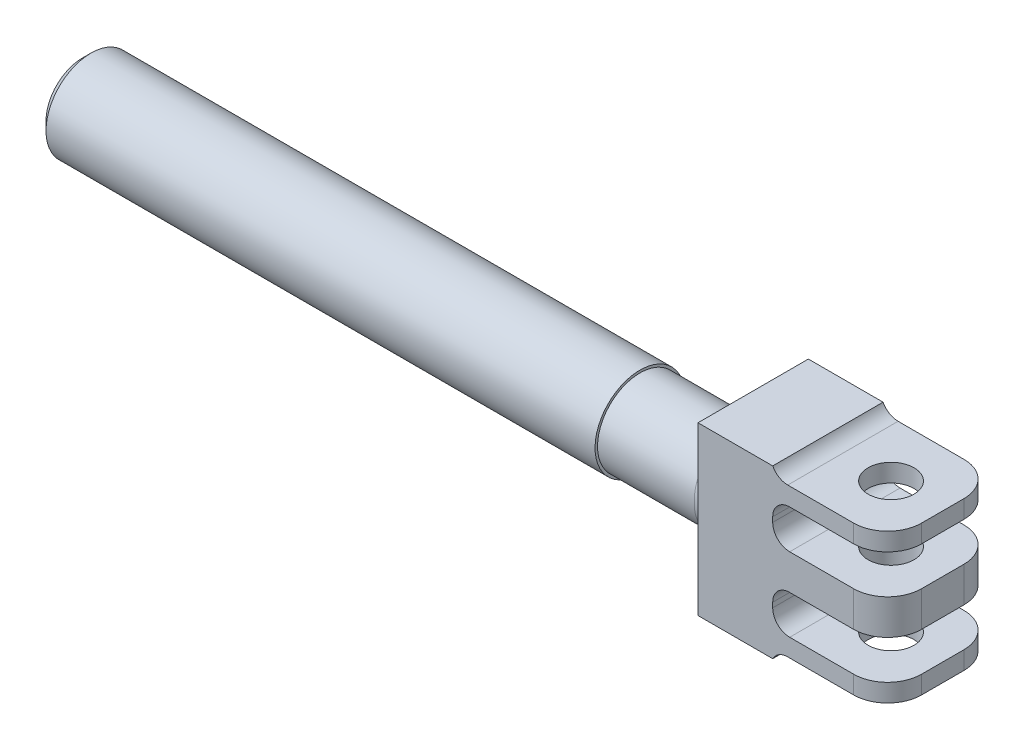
ISO-10303-21;
HEADER;
FILE_DESCRIPTION(('STEP AP214'),'2;1');
FILE_NAME('part.step','',(''),(''),'','','');
FILE_SCHEMA(('AUTOMOTIVE_DESIGN { 1 0 10303 214 1 1 1 1 }'));
ENDSEC;
DATA;
#1=APPLICATION_CONTEXT('core data for automotive mechanical design processes');
#2=APPLICATION_PROTOCOL_DEFINITION('international standard','automotive_design',2000,#1);
#3=PRODUCT_CONTEXT('',#1,'mechanical');
#4=PRODUCT('Part','Part','',(#3));
#5=PRODUCT_RELATED_PRODUCT_CATEGORY('part','',(#4));
#6=PRODUCT_DEFINITION_FORMATION('','',#4);
#7=PRODUCT_DEFINITION_CONTEXT('part definition',#1,'design');
#8=PRODUCT_DEFINITION('design','',#6,#7);
#9=PRODUCT_DEFINITION_SHAPE('','',#8);
#10=(LENGTH_UNIT() NAMED_UNIT(*) SI_UNIT(.MILLI.,.METRE.));
#11=(NAMED_UNIT(*) PLANE_ANGLE_UNIT() SI_UNIT($,.RADIAN.));
#12=(NAMED_UNIT(*) SI_UNIT($,.STERADIAN.) SOLID_ANGLE_UNIT());
#13=UNCERTAINTY_MEASURE_WITH_UNIT(LENGTH_MEASURE(1.E-05),#10,'distance_accuracy_value','');
#14=(GEOMETRIC_REPRESENTATION_CONTEXT(3) GLOBAL_UNCERTAINTY_ASSIGNED_CONTEXT((#13)) GLOBAL_UNIT_ASSIGNED_CONTEXT((#10,
#11,#12)) REPRESENTATION_CONTEXT('',''));
#15=CARTESIAN_POINT('',(0.,0.,0.));
#16=DIRECTION('',(0.,0.,1.));
#17=DIRECTION('',(1.,0.,0.));
#18=AXIS2_PLACEMENT_3D('',#15,#16,#17);
#19=CARTESIAN_POINT('',(0.,14.7499999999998,-9.75));
#20=DIRECTION('',(-1.,0.,0.));
#21=DIRECTION('',(0.,-1.,0.));
#22=AXIS2_PLACEMENT_3D('',#19,#20,#21);
#23=PLANE('',#22);
#24=DIRECTION('',(0.,-1.,0.));
#25=VECTOR('',#24,1.);
#26=CARTESIAN_POINT('',(0.,14.7499999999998,-9.75));
#27=LINE('',#26,#25);
#28=CARTESIAN_POINT('',(0.,14.7499999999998,-9.75));
#29=VERTEX_POINT('',#28);
#30=CARTESIAN_POINT('',(0.,3.89711431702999,-9.75));
#31=VERTEX_POINT('',#30);
#32=EDGE_CURVE('E242',#29,#31,#27,.T.);
#33=ORIENTED_EDGE('',*,*,#32,.T.);
#34=CARTESIAN_POINT('',(0.,0.,0.));
#35=DIRECTION('',(-1.,0.,0.));
#36=DIRECTION('',(0.,-1.,0.));
#37=AXIS2_PLACEMENT_3D('',#34,#35,#36);
#38=CIRCLE('',#37,10.5);
#39=CARTESIAN_POINT('',(0.,3.89711431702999,9.75));
#40=VERTEX_POINT('',#39);
#41=EDGE_CURVE('E12',#31,#40,#38,.F.);
#42=ORIENTED_EDGE('',*,*,#41,.T.);
#43=DIRECTION('',(0.,-1.,0.));
#44=VECTOR('',#43,1.);
#45=CARTESIAN_POINT('',(0.,14.7499999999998,9.75));
#46=LINE('',#45,#44);
#47=CARTESIAN_POINT('',(0.,14.7499999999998,9.75));
#48=VERTEX_POINT('',#47);
#49=EDGE_CURVE('E369',#48,#40,#46,.T.);
#50=ORIENTED_EDGE('',*,*,#49,.F.);
#51=DIRECTION('',(0.,0.,1.));
#52=VECTOR('',#51,1.);
#53=CARTESIAN_POINT('',(0.,14.7499999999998,-9.75));
#54=LINE('',#53,#52);
#55=EDGE_CURVE('E230',#29,#48,#54,.T.);
#56=ORIENTED_EDGE('',*,*,#55,.F.);
#57=EDGE_LOOP('',(#33,#42,#50,#56));
#58=FACE_BOUND('',#57,.T.);
#59=ADVANCED_FACE('F18',(#58),#23,.T.);
#60=CARTESIAN_POINT('',(-291.713203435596,0.,0.));
#61=DIRECTION('',(1.,0.,0.));
#62=DIRECTION('',(0.,1.,0.));
#63=AXIS2_PLACEMENT_3D('',#60,#61,#62);
#64=CYLINDRICAL_SURFACE('',#63,7.5);
#65=CARTESIAN_POINT('',(-3.,0.,0.));
#66=DIRECTION('',(-1.,0.,0.));
#67=DIRECTION('',(0.,-1.,0.));
#68=AXIS2_PLACEMENT_3D('',#65,#66,#67);
#69=CIRCLE('',#68,7.5);
#70=CARTESIAN_POINT('',(-3.,2.78365308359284,6.96428571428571));
#71=VERTEX_POINT('',#70);
#72=CARTESIAN_POINT('',(-3.,2.78365308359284,-6.96428571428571));
#73=VERTEX_POINT('',#72);
#74=EDGE_CURVE('E262',#71,#73,#69,.T.);
#75=ORIENTED_EDGE('',*,*,#74,.T.);
#76=CARTESIAN_POINT('',(-2.97618187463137,3.38077932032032,-6.69479881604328));
#77=CARTESIAN_POINT('',(0.376351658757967,3.20977338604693,-6.78115440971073));
#78=CARTESIAN_POINT('',(0.,4.73309104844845,-9.75));
#79=CARTESIAN_POINT('',(-2.98381418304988,3.29548150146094,-6.73787494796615));
#80=CARTESIAN_POINT('',(0.312853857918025,3.15884841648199,-6.80419612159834));
#81=CARTESIAN_POINT('',(0.,4.613674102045,-9.75));
#82=CARTESIAN_POINT('',(-2.98932589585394,3.20930517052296,-6.77934473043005));
#83=CARTESIAN_POINT('',(0.252838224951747,3.10216809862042,-6.82968160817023));
#84=CARTESIAN_POINT('',(0.,4.493027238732,-9.75));
#85=CARTESIAN_POINT('',(-2.99689820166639,3.03538905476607,-6.85897606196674));
#86=CARTESIAN_POINT('',(0.140949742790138,2.97970001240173,-6.88321615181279));
#87=CARTESIAN_POINT('',(0.,4.24954467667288,-9.75));
#88=CARTESIAN_POINT('',(-2.99895979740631,2.94764973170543,-6.89713856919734));
#89=CARTESIAN_POINT('',(0.0888630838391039,2.91399537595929,-6.91125381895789));
#90=CARTESIAN_POINT('',(0.,4.12670962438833,-9.75));
#91=CARTESIAN_POINT('',(-3.00115667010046,2.68249751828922,-7.00647763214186));
#92=CARTESIAN_POINT('',(-0.0546564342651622,2.70703422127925,-6.99589659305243));
#93=CARTESIAN_POINT('',(0.,3.75549652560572,-9.75));
#94=CARTESIAN_POINT('',(-2.99731737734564,2.50296138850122,-7.07260115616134));
#95=CARTESIAN_POINT('',(-0.136830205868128,2.55269056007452,-7.05457718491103));
#96=CARTESIAN_POINT('',(0.,3.50414594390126,-9.75));
#97=CARTESIAN_POINT('',(-2.98434137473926,2.13976709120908,-7.19081611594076));
#98=CARTESIAN_POINT('',(-0.275110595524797,2.22259158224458,-7.16564870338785));
#99=CARTESIAN_POINT('',(0.,2.99567392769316,-9.75));
#100=CARTESIAN_POINT('',(-2.97521241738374,1.95611533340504,-7.2429279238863));
#101=CARTESIAN_POINT('',(-0.332263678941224,2.04649642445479,-7.21850219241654));
#102=CARTESIAN_POINT('',(0.,2.73856146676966,-9.75));
#103=CARTESIAN_POINT('',(-2.95594191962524,1.58535017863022,-7.33301190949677));
#104=CARTESIAN_POINT('',(-0.426021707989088,1.67969651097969,-7.31250960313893));
#105=CARTESIAN_POINT('',(0.,2.21949025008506,-9.75));
#106=CARTESIAN_POINT('',(-2.94580012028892,1.39823590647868,-7.37098045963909));
#107=CARTESIAN_POINT('',(-0.463260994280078,1.48822391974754,-7.35413893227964));
#108=CARTESIAN_POINT('',(0.,1.95753026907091,-9.75));
#109=CARTESIAN_POINT('',(-2.92741443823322,1.01289276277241,-7.43396924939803));
#110=CARTESIAN_POINT('',(-0.522678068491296,1.08743404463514,-7.42398648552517));
#111=CARTESIAN_POINT('',(0.,1.41804986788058,-9.75));
#112=CARTESIAN_POINT('',(-2.91927983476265,0.814549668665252,-7.45831053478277));
#113=CARTESIAN_POINT('',(-0.544510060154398,0.876449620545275,-7.45194201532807));
#114=CARTESIAN_POINT('',(0.,1.14036953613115,-9.75));
#115=CARTESIAN_POINT('',(-2.90802712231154,0.416496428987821,-7.49108829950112));
#116=CARTESIAN_POINT('',(-0.573346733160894,0.450467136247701,-7.48955377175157));
#117=CARTESIAN_POINT('',(0.,0.583095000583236,-9.75));
#118=CARTESIAN_POINT('',(-2.90490848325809,0.216786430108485,-7.4995264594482));
#119=CARTESIAN_POINT('',(-0.580541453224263,0.234145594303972,-7.49945094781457));
#120=CARTESIAN_POINT('',(0.,0.303501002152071,-9.75));
#121=CARTESIAN_POINT('',(-2.9045805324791,-0.182703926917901,-7.50043481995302));
#122=CARTESIAN_POINT('',(-0.581320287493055,-0.197297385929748,-7.50050404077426));
#123=CARTESIAN_POINT('',(0.,-0.255785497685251,-9.75));
#124=CARTESIAN_POINT('',(-2.90737211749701,-0.382484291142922,-7.49290259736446));
#125=CARTESIAN_POINT('',(-0.574907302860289,-0.413799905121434,-7.49166389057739));
#126=CARTESIAN_POINT('',(0.,-0.535478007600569,-9.75));
#127=CARTESIAN_POINT('',(-2.9180656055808,-0.780757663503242,-7.46192498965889));
#128=CARTESIAN_POINT('',(-0.547728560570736,-0.840443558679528,-7.45607780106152));
#129=CARTESIAN_POINT('',(0.,-1.0930607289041,-9.75));
#130=CARTESIAN_POINT('',(-2.92596828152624,-0.979250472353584,-7.43847719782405));
#131=CARTESIAN_POINT('',(-0.526783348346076,-1.05191463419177,-7.42910258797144));
#132=CARTESIAN_POINT('',(0.,-1.37095066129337,-9.75));
#133=CARTESIAN_POINT('',(-2.94479185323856,-1.38002965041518,-7.37482218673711));
#134=CARTESIAN_POINT('',(-0.467005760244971,-1.4698764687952,-7.35828664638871));
#135=CARTESIAN_POINT('',(0.,-1.93204151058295,-9.75));
#136=CARTESIAN_POINT('',(-2.95580186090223,-1.58223194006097,-7.33409890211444));
#137=CARTESIAN_POINT('',(-0.427189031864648,-1.67716526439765,-7.31348213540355));
#138=CARTESIAN_POINT('',(0.,-2.21512471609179,-9.75));
#139=CARTESIAN_POINT('',(-2.97656423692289,-1.98257052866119,-7.23615103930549));
#140=CARTESIAN_POINT('',(-0.325006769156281,-2.0726873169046,-7.21143952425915));
#141=CARTESIAN_POINT('',(0.,-2.77559874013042,-9.75));
#142=CARTESIAN_POINT('',(-2.98631692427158,-2.18070784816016,-7.17893065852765));
#143=CARTESIAN_POINT('',(-0.261832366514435,-2.2618798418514,-7.15359961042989));
#144=CARTESIAN_POINT('',(0.,-3.05299098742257,-9.75));
#145=CARTESIAN_POINT('',(-2.9991097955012,-2.57216395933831,-7.0481635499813));
#146=CARTESIAN_POINT('',(-0.106949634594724,-2.6136852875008,-7.03245609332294));
#147=CARTESIAN_POINT('',(0.,-3.60102954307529,-9.75));
#148=CARTESIAN_POINT('',(-3.00213621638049,-2.76547207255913,-6.97458368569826));
#149=CARTESIAN_POINT('',(-0.0138508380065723,-2.77664878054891,-6.9685827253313));
#150=CARTESIAN_POINT('',(0.,-3.87166090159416,-9.75));
#151=CARTESIAN_POINT('',(-2.9964517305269,-3.05038458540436,-6.85243453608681));
#152=CARTESIAN_POINT('',(0.149923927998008,-2.99090115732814,-6.87855871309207));
#153=CARTESIAN_POINT('',(0.,-4.27053841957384,-9.75));
#154=CARTESIAN_POINT('',(-2.99284677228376,-3.14457795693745,-6.80972090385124));
#155=CARTESIAN_POINT('',(0.209673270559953,-3.05819455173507,-6.84906880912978));
#156=CARTESIAN_POINT('',(0.,-4.4024091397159,-9.75));
#157=CARTESIAN_POINT('',(-2.98117625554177,-3.33104095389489,-6.72048085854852));
#158=CARTESIAN_POINT('',(0.338338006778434,-3.18159750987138,-6.79404093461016));
#159=CARTESIAN_POINT('',(0.,-4.66345733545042,-9.75));
#160=CARTESIAN_POINT('',(-2.973108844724,-3.42330976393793,-6.67395286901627));
#161=CARTESIAN_POINT('',(0.407539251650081,-3.23756692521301,-6.7685439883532));
#162=CARTESIAN_POINT('',(0.,-4.79263366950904,-9.75));
#163=CARTESIAN_POINT('',(-2.96228911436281,-3.51448137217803,-6.62558832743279));
#164=CARTESIAN_POINT('',(0.480755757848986,-3.28633251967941,-6.74660775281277));
#165=CARTESIAN_POINT('',(0.,-4.92027392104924,-9.75));
#166=(BOUNDED_SURFACE() B_SPLINE_SURFACE(3,2,((#76,#77,#78),(#79,#80,#81),(#82,#83,#84),(#85,
#86,#87),(#88,#89,#90),(#91,#92,#93),(#94,#95,#96),(#97,#98,#99),(#100,#101,#102),(#103,#104,
#105),(#106,#107,#108),(#109,#110,#111),(#112,#113,#114),(#115,#116,#117),(#118,#119,#120),
(#121,#122,#123),(#124,#125,#126),(#127,#128,#129),(#130,#131,#132),(#133,#134,#135),(#136,#137,
#138),(#139,#140,#141),(#142,#143,#144),(#145,#146,#147),(#148,#149,#150),(#151,#152,#153),
(#154,#155,#156),(#157,#158,#159),(#160,#161,#162),(#163,#164,#165)),.UNSPECIFIED.,.F.,.F.,
.F.) B_SPLINE_SURFACE_WITH_KNOTS((4,2,2,2,2,2,2,2,2,2,2,2,2,2,4),(3,3),(0.,0.401893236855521,
0.803669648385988,1.60633551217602,2.40782795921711,3.20952583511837,4.04824757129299,
4.88688066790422,5.72564101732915,6.56452823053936,7.43046741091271,8.29618646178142,
9.16367528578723,9.59802803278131,10.0325612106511),(0.,1.),
.UNSPECIFIED.) GEOMETRIC_REPRESENTATION_ITEM() RATIONAL_B_SPLINE_SURFACE(((1.,0.666236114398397,
1.),(1.,0.672698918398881,1.),(1.,0.678955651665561,1.),(1.,0.691024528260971,1.),(1.,
0.696836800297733,1.),(1.,0.713551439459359,1.),(1.,0.723746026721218,1.),(1.,0.742060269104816,
1.),(1.,0.750182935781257,1.),(1.,0.764268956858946,1.),(1.,0.770231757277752,1.),(1.,
0.780141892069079,1.),(1.,0.783983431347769,1.),(1.,0.789159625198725,1.),(1.,0.790494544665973,
1.),(1.,0.790638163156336,1.),(1.,0.789446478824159,1.),(1.,0.784553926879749,1.),(1.,
0.780852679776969,1.),(1.,0.770834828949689,1.),(1.,0.764437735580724,1.),(1.,0.749124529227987,
1.),(1.,0.740209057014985,1.),(1.,0.719973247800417,1.),(1.,0.708648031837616,1.),(1.,
0.690030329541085,1.),(1.,0.683547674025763,1.),(1.,0.670080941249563,1.),(1.,0.663096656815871,
1.),(1.,0.655884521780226,1.))) REPRESENTATION_ITEM('') SURFACE());
#167=CARTESIAN_POINT('',(-2.97618187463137,3.38077932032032,-6.69479881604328));
#168=CARTESIAN_POINT('',(-2.98381418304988,3.29548150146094,-6.73787494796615));
#169=CARTESIAN_POINT('',(-2.98932589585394,3.20930517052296,-6.77934473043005));
#170=CARTESIAN_POINT('',(-2.99689820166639,3.03538905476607,-6.85897606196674));
#171=CARTESIAN_POINT('',(-2.99895979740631,2.94764973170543,-6.89713856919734));
#172=CARTESIAN_POINT('',(-3.00115667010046,2.68249751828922,-7.00647763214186));
#173=CARTESIAN_POINT('',(-2.99731737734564,2.50296138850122,-7.07260115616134));
#174=CARTESIAN_POINT('',(-2.98434137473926,2.13976709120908,-7.19081611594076));
#175=CARTESIAN_POINT('',(-2.97521241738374,1.95611533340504,-7.2429279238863));
#176=CARTESIAN_POINT('',(-2.95594191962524,1.58535017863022,-7.33301190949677));
#177=CARTESIAN_POINT('',(-2.94580012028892,1.39823590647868,-7.37098045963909));
#178=CARTESIAN_POINT('',(-2.92741443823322,1.01289276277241,-7.43396924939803));
#179=CARTESIAN_POINT('',(-2.91927983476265,0.814549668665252,-7.45831053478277));
#180=CARTESIAN_POINT('',(-2.90802712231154,0.416496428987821,-7.49108829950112));
#181=CARTESIAN_POINT('',(-2.90490848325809,0.216786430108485,-7.4995264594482));
#182=CARTESIAN_POINT('',(-2.9045805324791,-0.182703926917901,-7.50043481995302));
#183=CARTESIAN_POINT('',(-2.90737211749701,-0.382484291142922,-7.49290259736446));
#184=CARTESIAN_POINT('',(-2.9180656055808,-0.780757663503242,-7.4619249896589));
#185=CARTESIAN_POINT('',(-2.92596828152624,-0.979250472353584,-7.43847719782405));
#186=CARTESIAN_POINT('',(-2.94479185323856,-1.38002965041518,-7.37482218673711));
#187=CARTESIAN_POINT('',(-2.95580186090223,-1.58223194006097,-7.33409890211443));
#188=CARTESIAN_POINT('',(-2.97656423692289,-1.98257052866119,-7.23615103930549));
#189=CARTESIAN_POINT('',(-2.98631692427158,-2.18070784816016,-7.17893065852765));
#190=CARTESIAN_POINT('',(-2.9991097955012,-2.57216395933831,-7.0481635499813));
#191=CARTESIAN_POINT('',(-3.00213621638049,-2.76547207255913,-6.97458368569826));
#192=CARTESIAN_POINT('',(-2.9964517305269,-3.05038458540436,-6.85243453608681));
#193=CARTESIAN_POINT('',(-2.99284677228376,-3.14457795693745,-6.80972090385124));
#194=CARTESIAN_POINT('',(-2.98117625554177,-3.33104095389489,-6.72048085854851));
#195=CARTESIAN_POINT('',(-2.973108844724,-3.42330976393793,-6.67395286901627));
#196=CARTESIAN_POINT('',(-2.96228911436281,-3.51448137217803,-6.62558832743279));
#197=B_SPLINE_CURVE_WITH_KNOTS('',3,(#167,#168,#169,#170,#171,#172,#173,#174,#175,#176,#177,
#178,#179,#180,#181,#182,#183,#184,#185,#186,#187,#188,#189,#190,#191,#192,#193,#194,#195,#196),
.UNSPECIFIED.,.F.,.F.,(4,2,2,2,2,2,2,2,2,2,2,2,2,2,4),(0.,0.401893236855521,0.803669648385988,
1.60633551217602,2.40782795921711,3.20952583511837,4.04824757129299,4.88688066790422,
5.72564101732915,6.56452823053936,7.43046741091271,8.29618646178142,9.16367528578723,
9.59802803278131,10.0325612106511),.UNSPECIFIED.);
#198=CARTESIAN_POINT('',(-3.,-2.78365308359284,-6.96428571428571));
#199=VERTEX_POINT('',#198);
#200=EDGE_CURVE('E380',#73,#199,#197,.T.);
#201=ORIENTED_EDGE('',*,*,#200,.T.);
#202=CARTESIAN_POINT('',(-3.,0.,0.));
#203=DIRECTION('',(-1.,0.,0.));
#204=DIRECTION('',(0.,-1.,0.));
#205=AXIS2_PLACEMENT_3D('',#202,#203,#204);
#206=CIRCLE('',#205,7.5);
#207=CARTESIAN_POINT('',(-3.,-2.78365308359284,6.96428571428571));
#208=VERTEX_POINT('',#207);
#209=EDGE_CURVE('E277',#199,#208,#206,.T.);
#210=ORIENTED_EDGE('',*,*,#209,.T.);
#211=CARTESIAN_POINT('',(-2.97618187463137,-3.38077932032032,6.69479881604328));
#212=CARTESIAN_POINT('',(0.376351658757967,-3.20977338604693,6.78115440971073));
#213=CARTESIAN_POINT('',(0.,-4.73309104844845,9.75));
#214=CARTESIAN_POINT('',(-2.98381418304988,-3.29548150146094,6.73787494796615));
#215=CARTESIAN_POINT('',(0.312853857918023,-3.15884841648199,6.80419612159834));
#216=CARTESIAN_POINT('',(0.,-4.613674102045,9.75));
#217=CARTESIAN_POINT('',(-2.98932589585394,-3.20930517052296,6.77934473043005));
#218=CARTESIAN_POINT('',(0.252838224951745,-3.10216809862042,6.82968160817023));
#219=CARTESIAN_POINT('',(0.,-4.493027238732,9.75));
#220=CARTESIAN_POINT('',(-2.99689820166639,-3.03538905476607,6.85897606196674));
#221=CARTESIAN_POINT('',(0.140949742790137,-2.97970001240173,6.88321615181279));
#222=CARTESIAN_POINT('',(0.,-4.24954467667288,9.75));
#223=CARTESIAN_POINT('',(-2.99895979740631,-2.94764973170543,6.89713856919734));
#224=CARTESIAN_POINT('',(0.0888630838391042,-2.91399537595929,6.91125381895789));
#225=CARTESIAN_POINT('',(0.,-4.12670962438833,9.75));
#226=CARTESIAN_POINT('',(-3.00115667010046,-2.68249751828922,7.00647763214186));
#227=CARTESIAN_POINT('',(-0.0546564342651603,-2.70703422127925,6.99589659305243));
#228=CARTESIAN_POINT('',(0.,-3.75549652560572,9.75));
#229=CARTESIAN_POINT('',(-2.99731737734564,-2.50296138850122,7.07260115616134));
#230=CARTESIAN_POINT('',(-0.136830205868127,-2.55269056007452,7.05457718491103));
#231=CARTESIAN_POINT('',(0.,-3.50414594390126,9.75));
#232=CARTESIAN_POINT('',(-2.98434137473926,-2.13976709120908,7.19081611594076));
#233=CARTESIAN_POINT('',(-0.275110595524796,-2.22259158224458,7.16564870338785));
#234=CARTESIAN_POINT('',(0.,-2.99567392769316,9.75));
#235=CARTESIAN_POINT('',(-2.97521241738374,-1.95611533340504,7.2429279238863));
#236=CARTESIAN_POINT('',(-0.332263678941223,-2.04649642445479,7.21850219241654));
#237=CARTESIAN_POINT('',(0.,-2.73856146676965,9.75));
#238=CARTESIAN_POINT('',(-2.95594191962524,-1.58535017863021,7.33301190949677));
#239=CARTESIAN_POINT('',(-0.426021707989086,-1.67969651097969,7.31250960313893));
#240=CARTESIAN_POINT('',(0.,-2.21949025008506,9.75));
#241=CARTESIAN_POINT('',(-2.94580012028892,-1.39823590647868,7.37098045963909));
#242=CARTESIAN_POINT('',(-0.463260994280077,-1.48822391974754,7.35413893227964));
#243=CARTESIAN_POINT('',(0.,-1.95753026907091,9.75));
#244=CARTESIAN_POINT('',(-2.92741443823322,-1.0128927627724,7.43396924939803));
#245=CARTESIAN_POINT('',(-0.522678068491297,-1.08743404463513,7.42398648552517));
#246=CARTESIAN_POINT('',(0.,-1.41804986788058,9.75));
#247=CARTESIAN_POINT('',(-2.91927983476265,-0.814549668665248,7.45831053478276));
#248=CARTESIAN_POINT('',(-0.5445100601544,-0.876449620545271,7.45194201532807));
#249=CARTESIAN_POINT('',(0.,-1.14036953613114,9.75));
#250=CARTESIAN_POINT('',(-2.90802712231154,-0.416496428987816,7.49108829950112));
#251=CARTESIAN_POINT('',(-0.573346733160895,-0.450467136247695,7.48955377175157));
#252=CARTESIAN_POINT('',(0.,-0.583095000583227,9.75));
#253=CARTESIAN_POINT('',(-2.90490848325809,-0.21678643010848,7.4995264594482));
#254=CARTESIAN_POINT('',(-0.580541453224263,-0.234145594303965,7.49945094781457));
#255=CARTESIAN_POINT('',(0.,-0.303501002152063,9.75));
#256=CARTESIAN_POINT('',(-2.9045805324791,0.182703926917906,7.50043481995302));
#257=CARTESIAN_POINT('',(-0.581320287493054,0.197297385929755,7.50050404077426));
#258=CARTESIAN_POINT('',(0.,0.25578549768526,9.75));
#259=CARTESIAN_POINT('',(-2.90737211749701,0.382484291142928,7.49290259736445));
#260=CARTESIAN_POINT('',(-0.57490730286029,0.413799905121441,7.49166389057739));
#261=CARTESIAN_POINT('',(0.,0.535478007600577,9.75));
#262=CARTESIAN_POINT('',(-2.9180656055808,0.780757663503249,7.46192498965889));
#263=CARTESIAN_POINT('',(-0.547728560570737,0.840443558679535,7.45607780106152));
#264=CARTESIAN_POINT('',(0.,1.09306072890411,9.75));
#265=CARTESIAN_POINT('',(-2.92596828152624,0.97925047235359,7.43847719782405));
#266=CARTESIAN_POINT('',(-0.526783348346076,1.05191463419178,7.42910258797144));
#267=CARTESIAN_POINT('',(0.,1.37095066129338,9.75));
#268=CARTESIAN_POINT('',(-2.94479185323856,1.38002965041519,7.37482218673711));
#269=CARTESIAN_POINT('',(-0.467005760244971,1.46987646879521,7.35828664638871));
#270=CARTESIAN_POINT('',(0.,1.93204151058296,9.75));
#271=CARTESIAN_POINT('',(-2.95580186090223,1.58223194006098,7.33409890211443));
#272=CARTESIAN_POINT('',(-0.427189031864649,1.67716526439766,7.31348213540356));
#273=CARTESIAN_POINT('',(0.,2.2151247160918,9.75));
#274=CARTESIAN_POINT('',(-2.97656423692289,1.98257052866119,7.23615103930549));
#275=CARTESIAN_POINT('',(-0.325006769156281,2.0726873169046,7.21143952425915));
#276=CARTESIAN_POINT('',(0.,2.77559874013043,9.75));
#277=CARTESIAN_POINT('',(-2.98631692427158,2.18070784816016,7.17893065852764));
#278=CARTESIAN_POINT('',(-0.261832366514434,2.26187984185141,7.15359961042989));
#279=CARTESIAN_POINT('',(0.,3.05299098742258,9.75));
#280=CARTESIAN_POINT('',(-2.9991097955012,2.57216395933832,7.0481635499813));
#281=CARTESIAN_POINT('',(-0.10694963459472,2.6136852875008,7.03245609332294));
#282=CARTESIAN_POINT('',(0.,3.6010295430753,9.75));
#283=CARTESIAN_POINT('',(-3.00213621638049,2.76547207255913,6.97458368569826));
#284=CARTESIAN_POINT('',(-0.0138508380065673,2.77664878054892,6.9685827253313));
#285=CARTESIAN_POINT('',(0.,3.87166090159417,9.75));
#286=CARTESIAN_POINT('',(-2.9964517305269,3.05038458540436,6.85243453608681));
#287=CARTESIAN_POINT('',(0.149923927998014,2.99090115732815,6.87855871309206));
#288=CARTESIAN_POINT('',(0.,4.27053841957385,9.75));
#289=CARTESIAN_POINT('',(-2.99284677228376,3.14457795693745,6.80972090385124));
#290=CARTESIAN_POINT('',(0.209673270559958,3.05819455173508,6.84906880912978));
#291=CARTESIAN_POINT('',(0.,4.40240913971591,9.75));
#292=CARTESIAN_POINT('',(-2.98117625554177,3.33104095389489,6.72048085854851));
#293=CARTESIAN_POINT('',(0.33833800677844,3.18159750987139,6.79404093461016));
#294=CARTESIAN_POINT('',(0.,4.66345733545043,9.75));
#295=CARTESIAN_POINT('',(-2.973108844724,3.42330976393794,6.67395286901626));
#296=CARTESIAN_POINT('',(0.407539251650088,3.23756692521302,6.7685439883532));
#297=CARTESIAN_POINT('',(0.,4.79263366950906,9.75));
#298=CARTESIAN_POINT('',(-2.96228911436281,3.51448137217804,6.62558832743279));
#299=CARTESIAN_POINT('',(0.480755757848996,3.28633251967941,6.74660775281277));
#300=CARTESIAN_POINT('',(0.,4.92027392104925,9.75));
#301=(BOUNDED_SURFACE() B_SPLINE_SURFACE(3,2,((#211,#212,#213),(#214,#215,#216),(#217,#218,
#219),(#220,#221,#222),(#223,#224,#225),(#226,#227,#228),(#229,#230,#231),(#232,#233,#234),
(#235,#236,#237),(#238,#239,#240),(#241,#242,#243),(#244,#245,#246),(#247,#248,#249),(#250,#251,
#252),(#253,#254,#255),(#256,#257,#258),(#259,#260,#261),(#262,#263,#264),(#265,#266,#267),
(#268,#269,#270),(#271,#272,#273),(#274,#275,#276),(#277,#278,#279),(#280,#281,#282),(#283,#284,
#285),(#286,#287,#288),(#289,#290,#291),(#292,#293,#294),(#295,#296,#297),(#298,#299,#300)),
.UNSPECIFIED.,.F.,.F.,.F.) B_SPLINE_SURFACE_WITH_KNOTS((4,2,2,2,2,2,2,2,2,2,2,2,2,2,4),(3,3),
(0.,0.401893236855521,0.803669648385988,1.60633551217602,2.40782795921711,3.20952583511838,
4.04824757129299,4.88688066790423,5.72564101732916,6.56452823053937,7.43046741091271,
8.29618646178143,9.16367528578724,9.59802803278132,10.0325612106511),(0.,1.),
.UNSPECIFIED.) GEOMETRIC_REPRESENTATION_ITEM() RATIONAL_B_SPLINE_SURFACE(((1.,0.666236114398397,
1.),(1.,0.672698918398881,1.),(1.,0.678955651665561,1.),(1.,0.691024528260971,1.),(1.,
0.696836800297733,1.),(1.,0.713551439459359,1.),(1.,0.723746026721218,1.),(1.,0.742060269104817,
1.),(1.,0.750182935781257,1.),(1.,0.764268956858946,1.),(1.,0.770231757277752,1.),(1.,
0.780141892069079,1.),(1.,0.783983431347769,1.),(1.,0.789159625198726,1.),(1.,0.790494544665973,
1.),(1.,0.790638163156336,1.),(1.,0.789446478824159,1.),(1.,0.784553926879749,1.),(1.,
0.780852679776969,1.),(1.,0.770834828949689,1.),(1.,0.764437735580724,1.),(1.,0.749124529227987,
1.),(1.,0.740209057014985,1.),(1.,0.719973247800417,1.),(1.,0.708648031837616,1.),(1.,
0.690030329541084,1.),(1.,0.683547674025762,1.),(1.,0.670080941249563,1.),(1.,0.66309665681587,
1.),(1.,0.655884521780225,1.))) REPRESENTATION_ITEM('') SURFACE());
#302=CARTESIAN_POINT('',(-2.97618187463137,-3.38077932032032,6.69479881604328));
#303=CARTESIAN_POINT('',(-2.98381418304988,-3.29548150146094,6.73787494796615));
#304=CARTESIAN_POINT('',(-2.98932589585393,-3.20930517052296,6.77934473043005));
#305=CARTESIAN_POINT('',(-2.99689820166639,-3.03538905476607,6.85897606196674));
#306=CARTESIAN_POINT('',(-2.99895979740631,-2.94764973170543,6.89713856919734));
#307=CARTESIAN_POINT('',(-3.00115667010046,-2.68249751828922,7.00647763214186));
#308=CARTESIAN_POINT('',(-2.99731737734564,-2.50296138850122,7.07260115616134));
#309=CARTESIAN_POINT('',(-2.98434137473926,-2.13976709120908,7.19081611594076));
#310=CARTESIAN_POINT('',(-2.97521241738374,-1.95611533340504,7.2429279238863));
#311=CARTESIAN_POINT('',(-2.95594191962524,-1.58535017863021,7.33301190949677));
#312=CARTESIAN_POINT('',(-2.94580012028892,-1.39823590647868,7.37098045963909));
#313=CARTESIAN_POINT('',(-2.92741443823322,-1.0128927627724,7.43396924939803));
#314=CARTESIAN_POINT('',(-2.91927983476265,-0.814549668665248,7.45831053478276));
#315=CARTESIAN_POINT('',(-2.90802712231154,-0.416496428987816,7.49108829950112));
#316=CARTESIAN_POINT('',(-2.90490848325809,-0.21678643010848,7.4995264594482));
#317=CARTESIAN_POINT('',(-2.9045805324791,0.182703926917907,7.50043481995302));
#318=CARTESIAN_POINT('',(-2.90737211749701,0.382484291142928,7.49290259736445));
#319=CARTESIAN_POINT('',(-2.9180656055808,0.780757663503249,7.46192498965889));
#320=CARTESIAN_POINT('',(-2.92596828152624,0.97925047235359,7.43847719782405));
#321=CARTESIAN_POINT('',(-2.94479185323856,1.38002965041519,7.37482218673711));
#322=CARTESIAN_POINT('',(-2.95580186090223,1.58223194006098,7.33409890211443));
#323=CARTESIAN_POINT('',(-2.97656423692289,1.98257052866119,7.23615103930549));
#324=CARTESIAN_POINT('',(-2.98631692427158,2.18070784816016,7.17893065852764));
#325=CARTESIAN_POINT('',(-2.9991097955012,2.57216395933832,7.0481635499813));
#326=CARTESIAN_POINT('',(-3.00213621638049,2.76547207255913,6.97458368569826));
#327=CARTESIAN_POINT('',(-2.9964517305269,3.05038458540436,6.85243453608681));
#328=CARTESIAN_POINT('',(-2.99284677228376,3.14457795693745,6.80972090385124));
#329=CARTESIAN_POINT('',(-2.98117625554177,3.33104095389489,6.72048085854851));
#330=CARTESIAN_POINT('',(-2.973108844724,3.42330976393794,6.67395286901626));
#331=CARTESIAN_POINT('',(-2.96228911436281,3.51448137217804,6.62558832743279));
#332=B_SPLINE_CURVE_WITH_KNOTS('',3,(#302,#303,#304,#305,#306,#307,#308,#309,#310,#311,#312,
#313,#314,#315,#316,#317,#318,#319,#320,#321,#322,#323,#324,#325,#326,#327,#328,#329,#330,#331),
.UNSPECIFIED.,.F.,.F.,(4,2,2,2,2,2,2,2,2,2,2,2,2,2,4),(0.,0.401893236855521,0.803669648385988,
1.60633551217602,2.40782795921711,3.20952583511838,4.04824757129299,4.88688066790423,
5.72564101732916,6.56452823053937,7.43046741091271,8.29618646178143,9.16367528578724,
9.59802803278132,10.0325612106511),.UNSPECIFIED.);
#333=EDGE_CURVE('E269',#208,#71,#332,.T.);
#334=ORIENTED_EDGE('',*,*,#333,.T.);
#335=EDGE_LOOP('',(#75,#201,#210,#334));
#336=FACE_BOUND('',#335,.T.);
#337=CARTESIAN_POINT('',(-20.,0.,0.));
#338=DIRECTION('',(-1.,0.,0.));
#339=DIRECTION('',(0.,-1.,0.));
#340=AXIS2_PLACEMENT_3D('',#337,#338,#339);
#341=CIRCLE('',#340,7.5);
#342=CARTESIAN_POINT('',(-20.,-7.5,0.));
#343=VERTEX_POINT('',#342);
#344=EDGE_CURVE('E487',#343,#343,#341,.T.);
#345=ORIENTED_EDGE('',*,*,#344,.F.);
#346=EDGE_LOOP('',(#345));
#347=FACE_BOUND('',#346,.T.);
#348=ADVANCED_FACE('F279',(#336,#347),#64,.T.);
#349=CARTESIAN_POINT('',(0.,-3.89711431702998,9.75));
#350=VERTEX_POINT('',#349);
#351=CARTESIAN_POINT('',(0.,-14.7499999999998,9.75));
#352=VERTEX_POINT('',#351);
#353=EDGE_CURVE('E360',#350,#352,#46,.T.);
#354=ORIENTED_EDGE('',*,*,#353,.F.);
#355=CARTESIAN_POINT('',(0.,0.,0.));
#356=DIRECTION('',(-1.,0.,0.));
#357=DIRECTION('',(0.,-1.,0.));
#358=AXIS2_PLACEMENT_3D('',#355,#356,#357);
#359=CIRCLE('',#358,10.5);
#360=CARTESIAN_POINT('',(0.,-3.89711431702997,-9.75));
#361=VERTEX_POINT('',#360);
#362=EDGE_CURVE('E31',#350,#361,#359,.F.);
#363=ORIENTED_EDGE('',*,*,#362,.T.);
#364=CARTESIAN_POINT('',(0.,-14.7499999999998,-9.75));
#365=VERTEX_POINT('',#364);
#366=EDGE_CURVE('E243',#361,#365,#27,.T.);
#367=ORIENTED_EDGE('',*,*,#366,.T.);
#368=DIRECTION('',(0.,0.,1.));
#369=VECTOR('',#368,1.);
#370=CARTESIAN_POINT('',(0.,-14.7499999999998,-9.75));
#371=LINE('',#370,#369);
#372=EDGE_CURVE('E363',#365,#352,#371,.T.);
#373=ORIENTED_EDGE('',*,*,#372,.T.);
#374=EDGE_LOOP('',(#354,#363,#367,#373));
#375=FACE_BOUND('',#374,.T.);
#376=ADVANCED_FACE('F304',(#375),#23,.T.);
#377=CARTESIAN_POINT('',(33.5,3.11,-9.75));
#378=DIRECTION('',(0.,1.,0.));
#379=DIRECTION('',(-1.,0.,0.));
#380=AXIS2_PLACEMENT_3D('',#377,#378,#379);
#381=PLANE('',#380);
#382=CARTESIAN_POINT('',(24.36,3.11,0.));
#383=DIRECTION('',(0.,1.,0.));
#384=DIRECTION('',(-1.,0.,0.));
#385=AXIS2_PLACEMENT_3D('',#382,#383,#384);
#386=CIRCLE('',#385,4.05);
#387=CARTESIAN_POINT('',(20.31,3.11,0.));
#388=VERTEX_POINT('',#387);
#389=EDGE_CURVE('E702',#388,#388,#386,.T.);
#390=ORIENTED_EDGE('',*,*,#389,.F.);
#391=EDGE_LOOP('',(#390));
#392=FACE_BOUND('',#391,.T.);
#393=DIRECTION('',(-1.,0.,0.));
#394=VECTOR('',#393,1.);
#395=CARTESIAN_POINT('',(33.5,3.11,-9.75));
#396=LINE('',#395,#394);
#397=CARTESIAN_POINT('',(27.5,3.11,-9.75));
#398=VERTEX_POINT('',#397);
#399=CARTESIAN_POINT('',(16.2,3.11,-9.75));
#400=VERTEX_POINT('',#399);
#401=EDGE_CURVE('E446',#398,#400,#396,.T.);
#402=ORIENTED_EDGE('',*,*,#401,.T.);
#403=DIRECTION('',(0.,0.,1.));
#404=VECTOR('',#403,1.);
#405=CARTESIAN_POINT('',(16.2,3.11,9.75));
#406=LINE('',#405,#404);
#407=CARTESIAN_POINT('',(16.2,3.11,9.75));
#408=VERTEX_POINT('',#407);
#409=EDGE_CURVE('E449',#400,#408,#406,.T.);
#410=ORIENTED_EDGE('',*,*,#409,.T.);
#411=DIRECTION('',(-1.,0.,0.));
#412=VECTOR('',#411,1.);
#413=CARTESIAN_POINT('',(33.5,3.11,9.75));
#414=LINE('',#413,#412);
#415=CARTESIAN_POINT('',(27.5,3.11,9.75));
#416=VERTEX_POINT('',#415);
#417=EDGE_CURVE('E607',#416,#408,#414,.T.);
#418=ORIENTED_EDGE('',*,*,#417,.F.);
#419=CARTESIAN_POINT('',(27.5,3.11,3.75));
#420=DIRECTION('',(0.,1.,0.));
#421=DIRECTION('',(-1.,0.,0.));
#422=AXIS2_PLACEMENT_3D('',#419,#420,#421);
#423=CIRCLE('',#422,6.);
#424=CARTESIAN_POINT('',(33.5,3.11,3.75));
#425=VERTEX_POINT('',#424);
#426=EDGE_CURVE('E554',#416,#425,#423,.T.);
#427=ORIENTED_EDGE('',*,*,#426,.T.);
#428=DIRECTION('',(0.,0.,1.));
#429=VECTOR('',#428,1.);
#430=CARTESIAN_POINT('',(33.5,3.11,-9.75));
#431=LINE('',#430,#429);
#432=CARTESIAN_POINT('',(33.5,3.11,-3.75));
#433=VERTEX_POINT('',#432);
#434=EDGE_CURVE('E484',#433,#425,#431,.T.);
#435=ORIENTED_EDGE('',*,*,#434,.F.);
#436=CARTESIAN_POINT('',(27.5,3.11,-3.75));
#437=DIRECTION('',(0.,1.,0.));
#438=DIRECTION('',(-1.,0.,0.));
#439=AXIS2_PLACEMENT_3D('',#436,#437,#438);
#440=CIRCLE('',#439,6.);
#441=EDGE_CURVE('E556',#433,#398,#440,.T.);
#442=ORIENTED_EDGE('',*,*,#441,.T.);
#443=EDGE_LOOP('',(#402,#410,#418,#427,#435,#442));
#444=FACE_BOUND('',#443,.T.);
#445=ADVANCED_FACE('F351',(#392,#444),#381,.T.);
#446=CARTESIAN_POINT('',(33.5,-3.11,-9.75));
#447=DIRECTION('',(1.,0.,0.));
#448=DIRECTION('',(0.,0.,-1.));
#449=AXIS2_PLACEMENT_3D('',#446,#447,#448);
#450=PLANE('',#449);
#451=DIRECTION('',(0.,0.,1.));
#452=VECTOR('',#451,1.);
#453=CARTESIAN_POINT('',(33.5,-3.11,-9.75));
#454=LINE('',#453,#452);
#455=CARTESIAN_POINT('',(33.5,-3.11,-3.75));
#456=VERTEX_POINT('',#455);
#457=CARTESIAN_POINT('',(33.5,-3.11,3.75));
#458=VERTEX_POINT('',#457);
#459=EDGE_CURVE('E488',#456,#458,#454,.T.);
#460=ORIENTED_EDGE('',*,*,#459,.F.);
#461=DIRECTION('',(0.,1.,0.));
#462=VECTOR('',#461,1.);
#463=CARTESIAN_POINT('',(33.5,-3.11,-3.75));
#464=LINE('',#463,#462);
#465=EDGE_CURVE('E551',#456,#433,#464,.T.);
#466=ORIENTED_EDGE('',*,*,#465,.T.);
#467=ORIENTED_EDGE('',*,*,#434,.T.);
#468=DIRECTION('',(0.,1.,0.));
#469=VECTOR('',#468,1.);
#470=CARTESIAN_POINT('',(33.5,-3.11,3.75));
#471=LINE('',#470,#469);
#472=EDGE_CURVE('E549',#425,#458,#471,.F.);
#473=ORIENTED_EDGE('',*,*,#472,.T.);
#474=EDGE_LOOP('',(#460,#466,#467,#473));
#475=FACE_BOUND('',#474,.T.);
#476=ADVANCED_FACE('F356',(#475),#450,.T.);
#477=CARTESIAN_POINT('',(13.2,-3.11,-9.75));
#478=DIRECTION('',(0.,-1.,0.));
#479=DIRECTION('',(1.,0.,0.));
#480=AXIS2_PLACEMENT_3D('',#477,#478,#479);
#481=PLANE('',#480);
#482=CARTESIAN_POINT('',(24.36,-3.11,0.));
#483=DIRECTION('',(0.,-1.,0.));
#484=DIRECTION('',(1.,0.,0.));
#485=AXIS2_PLACEMENT_3D('',#482,#483,#484);
#486=CIRCLE('',#485,4.05);
#487=CARTESIAN_POINT('',(28.41,-3.11,0.));
#488=VERTEX_POINT('',#487);
#489=EDGE_CURVE('E704',#488,#488,#486,.T.);
#490=ORIENTED_EDGE('',*,*,#489,.F.);
#491=EDGE_LOOP('',(#490));
#492=FACE_BOUND('',#491,.T.);
#493=DIRECTION('',(1.,0.,0.));
#494=VECTOR('',#493,1.);
#495=CARTESIAN_POINT('',(13.2,-3.11,9.75));
#496=LINE('',#495,#494);
#497=CARTESIAN_POINT('',(16.2,-3.11,9.75));
#498=VERTEX_POINT('',#497);
#499=CARTESIAN_POINT('',(27.5,-3.11,9.75));
#500=VERTEX_POINT('',#499);
#501=EDGE_CURVE('E482',#498,#500,#496,.T.);
#502=ORIENTED_EDGE('',*,*,#501,.F.);
#503=DIRECTION('',(0.,0.,1.));
#504=VECTOR('',#503,1.);
#505=CARTESIAN_POINT('',(16.2,-3.11,-9.75));
#506=LINE('',#505,#504);
#507=CARTESIAN_POINT('',(16.2,-3.11,-9.75));
#508=VERTEX_POINT('',#507);
#509=EDGE_CURVE('E454',#498,#508,#506,.F.);
#510=ORIENTED_EDGE('',*,*,#509,.T.);
#511=DIRECTION('',(1.,0.,0.));
#512=VECTOR('',#511,1.);
#513=CARTESIAN_POINT('',(13.2,-3.11,-9.75));
#514=LINE('',#513,#512);
#515=CARTESIAN_POINT('',(27.5,-3.11,-9.75));
#516=VERTEX_POINT('',#515);
#517=EDGE_CURVE('E504',#508,#516,#514,.T.);
#518=ORIENTED_EDGE('',*,*,#517,.T.);
#519=CARTESIAN_POINT('',(27.5,-3.11,-3.75));
#520=DIRECTION('',(0.,-1.,0.));
#521=DIRECTION('',(1.,0.,0.));
#522=AXIS2_PLACEMENT_3D('',#519,#520,#521);
#523=CIRCLE('',#522,6.);
#524=EDGE_CURVE('E561',#516,#456,#523,.T.);
#525=ORIENTED_EDGE('',*,*,#524,.T.);
#526=ORIENTED_EDGE('',*,*,#459,.T.);
#527=CARTESIAN_POINT('',(27.5,-3.11,3.75));
#528=DIRECTION('',(0.,-1.,0.));
#529=DIRECTION('',(1.,0.,0.));
#530=AXIS2_PLACEMENT_3D('',#527,#528,#529);
#531=CIRCLE('',#530,6.);
#532=EDGE_CURVE('E558',#458,#500,#531,.T.);
#533=ORIENTED_EDGE('',*,*,#532,.T.);
#534=EDGE_LOOP('',(#502,#510,#518,#525,#526,#533));
#535=FACE_BOUND('',#534,.T.);
#536=ADVANCED_FACE('F576',(#492,#535),#481,.T.);
#537=CARTESIAN_POINT('',(13.2,-9.97000000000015,-9.75));
#538=DIRECTION('',(1.,0.,0.));
#539=DIRECTION('',(0.,1.,0.));
#540=AXIS2_PLACEMENT_3D('',#537,#538,#539);
#541=PLANE('',#540);
#542=DIRECTION('',(0.,1.,0.));
#543=VECTOR('',#542,1.);
#544=CARTESIAN_POINT('',(13.2,-9.97000000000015,9.75));
#545=LINE('',#544,#543);
#546=CARTESIAN_POINT('',(13.2,-6.97000000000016,9.75));
#547=VERTEX_POINT('',#546);
#548=CARTESIAN_POINT('',(13.2,-6.11,9.75));
#549=VERTEX_POINT('',#548);
#550=EDGE_CURVE('E479',#547,#549,#545,.T.);
#551=ORIENTED_EDGE('',*,*,#550,.F.);
#552=DIRECTION('',(0.,0.,1.));
#553=VECTOR('',#552,1.);
#554=CARTESIAN_POINT('',(13.2,-6.97000000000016,-9.75));
#555=LINE('',#554,#553);
#556=CARTESIAN_POINT('',(13.2,-6.97000000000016,-9.75));
#557=VERTEX_POINT('',#556);
#558=EDGE_CURVE('E571',#547,#557,#555,.F.);
#559=ORIENTED_EDGE('',*,*,#558,.T.);
#560=DIRECTION('',(0.,1.,0.));
#561=VECTOR('',#560,1.);
#562=CARTESIAN_POINT('',(13.2,-9.97000000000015,-9.75));
#563=LINE('',#562,#561);
#564=CARTESIAN_POINT('',(13.2,-6.11,-9.75));
#565=VERTEX_POINT('',#564);
#566=EDGE_CURVE('E584',#557,#565,#563,.T.);
#567=ORIENTED_EDGE('',*,*,#566,.T.);
#568=DIRECTION('',(0.,0.,1.));
#569=VECTOR('',#568,1.);
#570=CARTESIAN_POINT('',(13.2,-6.11,9.75));
#571=LINE('',#570,#569);
#572=EDGE_CURVE('E568',#565,#549,#571,.T.);
#573=ORIENTED_EDGE('',*,*,#572,.T.);
#574=EDGE_LOOP('',(#551,#559,#567,#573));
#575=FACE_BOUND('',#574,.T.);
#576=ADVANCED_FACE('F590',(#575),#541,.T.);
#577=CARTESIAN_POINT('',(33.5,-9.97000000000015,-9.75));
#578=DIRECTION('',(0.,1.,0.));
#579=DIRECTION('',(0.,0.,1.));
#580=AXIS2_PLACEMENT_3D('',#577,#578,#579);
#581=PLANE('',#580);
#582=CARTESIAN_POINT('',(24.36,-9.97000000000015,0.));
#583=DIRECTION('',(0.,1.,0.));
#584=DIRECTION('',(0.,0.,1.));
#585=AXIS2_PLACEMENT_3D('',#582,#583,#584);
#586=CIRCLE('',#585,4.05);
#587=CARTESIAN_POINT('',(24.36,-9.97000000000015,4.05));
#588=VERTEX_POINT('',#587);
#589=EDGE_CURVE('E708',#588,#588,#586,.T.);
#590=ORIENTED_EDGE('',*,*,#589,.F.);
#591=EDGE_LOOP('',(#590));
#592=FACE_BOUND('',#591,.T.);
#593=DIRECTION('',(-1.,0.,0.));
#594=VECTOR('',#593,1.);
#595=CARTESIAN_POINT('',(33.5,-9.97000000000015,-9.75));
#596=LINE('',#595,#594);
#597=CARTESIAN_POINT('',(27.5,-9.97000000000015,-9.75));
#598=VERTEX_POINT('',#597);
#599=CARTESIAN_POINT('',(16.2,-9.97000000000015,-9.75));
#600=VERTEX_POINT('',#599);
#601=EDGE_CURVE('E600',#598,#600,#596,.T.);
#602=ORIENTED_EDGE('',*,*,#601,.T.);
#603=DIRECTION('',(0.,0.,1.));
#604=VECTOR('',#603,1.);
#605=CARTESIAN_POINT('',(16.2,-9.97000000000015,9.75));
#606=LINE('',#605,#604);
#607=CARTESIAN_POINT('',(16.2,-9.97000000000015,9.75));
#608=VERTEX_POINT('',#607);
#609=EDGE_CURVE('E565',#600,#608,#606,.T.);
#610=ORIENTED_EDGE('',*,*,#609,.T.);
#611=DIRECTION('',(-1.,0.,0.));
#612=VECTOR('',#611,1.);
#613=CARTESIAN_POINT('',(33.5,-9.97000000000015,9.75));
#614=LINE('',#613,#612);
#615=CARTESIAN_POINT('',(27.5,-9.97000000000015,9.75));
#616=VERTEX_POINT('',#615);
#617=EDGE_CURVE('E476',#616,#608,#614,.T.);
#618=ORIENTED_EDGE('',*,*,#617,.F.);
#619=CARTESIAN_POINT('',(27.5,-9.97000000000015,3.75));
#620=DIRECTION('',(0.,1.,0.));
#621=DIRECTION('',(0.,0.,1.));
#622=AXIS2_PLACEMENT_3D('',#619,#620,#621);
#623=CIRCLE('',#622,6.);
#624=CARTESIAN_POINT('',(33.5,-9.97000000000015,3.75));
#625=VERTEX_POINT('',#624);
#626=EDGE_CURVE('E533',#616,#625,#623,.T.);
#627=ORIENTED_EDGE('',*,*,#626,.T.);
#628=DIRECTION('',(0.,0.,1.));
#629=VECTOR('',#628,1.);
#630=CARTESIAN_POINT('',(33.5,-9.97000000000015,-9.75));
#631=LINE('',#630,#629);
#632=CARTESIAN_POINT('',(33.5,-9.97000000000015,-3.75));
#633=VERTEX_POINT('',#632);
#634=EDGE_CURVE('E491',#633,#625,#631,.T.);
#635=ORIENTED_EDGE('',*,*,#634,.F.);
#636=CARTESIAN_POINT('',(27.5,-9.97000000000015,-3.75));
#637=DIRECTION('',(0.,1.,0.));
#638=DIRECTION('',(0.,0.,1.));
#639=AXIS2_PLACEMENT_3D('',#636,#637,#638);
#640=CIRCLE('',#639,6.);
#641=EDGE_CURVE('E535',#633,#598,#640,.T.);
#642=ORIENTED_EDGE('',*,*,#641,.T.);
#643=EDGE_LOOP('',(#602,#610,#618,#627,#635,#642));
#644=FACE_BOUND('',#643,.T.);
#645=ADVANCED_FACE('F599',(#592,#644),#581,.T.);
#646=CARTESIAN_POINT('',(33.5,-13.1500000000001,-9.75));
#647=DIRECTION('',(1.,0.,0.));
#648=DIRECTION('',(0.,1.,0.));
#649=AXIS2_PLACEMENT_3D('',#646,#647,#648);
#650=PLANE('',#649);
#651=DIRECTION('',(0.,0.,1.));
#652=VECTOR('',#651,1.);
#653=CARTESIAN_POINT('',(33.5,-13.1500000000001,-9.75));
#654=LINE('',#653,#652);
#655=CARTESIAN_POINT('',(33.5,-13.1500000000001,-3.75));
#656=VERTEX_POINT('',#655);
#657=CARTESIAN_POINT('',(33.5,-13.1500000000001,3.75));
#658=VERTEX_POINT('',#657);
#659=EDGE_CURVE('E494',#656,#658,#654,.T.);
#660=ORIENTED_EDGE('',*,*,#659,.F.);
#661=DIRECTION('',(0.,1.,0.));
#662=VECTOR('',#661,1.);
#663=CARTESIAN_POINT('',(33.5,-13.1500000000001,-3.75));
#664=LINE('',#663,#662);
#665=EDGE_CURVE('E530',#656,#633,#664,.T.);
#666=ORIENTED_EDGE('',*,*,#665,.T.);
#667=ORIENTED_EDGE('',*,*,#634,.T.);
#668=DIRECTION('',(0.,1.,0.));
#669=VECTOR('',#668,1.);
#670=CARTESIAN_POINT('',(33.5,-13.1500000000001,3.75));
#671=LINE('',#670,#669);
#672=EDGE_CURVE('E528',#625,#658,#671,.F.);
#673=ORIENTED_EDGE('',*,*,#672,.T.);
#674=EDGE_LOOP('',(#660,#666,#667,#673));
#675=FACE_BOUND('',#674,.T.);
#676=ADVANCED_FACE('F722',(#675),#650,.T.);
#677=CARTESIAN_POINT('',(13.2,-13.1500000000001,-9.75));
#678=DIRECTION('',(0.,-1.,0.));
#679=DIRECTION('',(1.,0.,0.));
#680=AXIS2_PLACEMENT_3D('',#677,#678,#679);
#681=PLANE('',#680);
#682=CARTESIAN_POINT('',(24.36,-13.1500000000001,0.));
#683=DIRECTION('',(0.,-1.,0.));
#684=DIRECTION('',(0.,0.,-1.));
#685=AXIS2_PLACEMENT_3D('',#682,#683,#684);
#686=CIRCLE('',#685,4.05);
#687=CARTESIAN_POINT('',(24.36,-13.1500000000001,-4.05));
#688=VERTEX_POINT('',#687);
#689=EDGE_CURVE('E267',#688,#688,#686,.T.);
#690=ORIENTED_EDGE('',*,*,#689,.F.);
#691=EDGE_LOOP('',(#690));
#692=FACE_BOUND('',#691,.T.);
#693=DIRECTION('',(1.,0.,0.));
#694=VECTOR('',#693,1.);
#695=CARTESIAN_POINT('',(13.2,-13.1500000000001,9.75));
#696=LINE('',#695,#694);
#697=CARTESIAN_POINT('',(15.8532998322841,-13.1500000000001,9.75));
#698=VERTEX_POINT('',#697);
#699=CARTESIAN_POINT('',(27.5,-13.1500000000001,9.75));
#700=VERTEX_POINT('',#699);
#701=EDGE_CURVE('E474',#698,#700,#696,.T.);
#702=ORIENTED_EDGE('',*,*,#701,.F.);
#703=DIRECTION('',(0.,0.,1.));
#704=VECTOR('',#703,1.);
#705=CARTESIAN_POINT('',(15.8532998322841,-13.1500000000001,-9.75));
#706=LINE('',#705,#704);
#707=CARTESIAN_POINT('',(15.8532998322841,-13.1500000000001,-9.75));
#708=VERTEX_POINT('',#707);
#709=EDGE_CURVE('E563',#698,#708,#706,.F.);
#710=ORIENTED_EDGE('',*,*,#709,.T.);
#711=DIRECTION('',(1.,0.,0.));
#712=VECTOR('',#711,1.);
#713=CARTESIAN_POINT('',(13.2,-13.1500000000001,-9.75));
#714=LINE('',#713,#712);
#715=CARTESIAN_POINT('',(27.5,-13.1500000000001,-9.75));
#716=VERTEX_POINT('',#715);
#717=EDGE_CURVE('E395',#708,#716,#714,.T.);
#718=ORIENTED_EDGE('',*,*,#717,.T.);
#719=CARTESIAN_POINT('',(27.5,-13.1500000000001,-3.75));
#720=DIRECTION('',(0.,-1.,0.));
#721=DIRECTION('',(1.,0.,0.));
#722=AXIS2_PLACEMENT_3D('',#719,#720,#721);
#723=CIRCLE('',#722,6.);
#724=EDGE_CURVE('E547',#716,#656,#723,.T.);
#725=ORIENTED_EDGE('',*,*,#724,.T.);
#726=ORIENTED_EDGE('',*,*,#659,.T.);
#727=CARTESIAN_POINT('',(27.5,-13.1500000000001,3.75));
#728=DIRECTION('',(0.,-1.,0.));
#729=DIRECTION('',(1.,0.,0.));
#730=AXIS2_PLACEMENT_3D('',#727,#728,#729);
#731=CIRCLE('',#730,6.);
#732=EDGE_CURVE('E544',#658,#700,#731,.T.);
#733=ORIENTED_EDGE('',*,*,#732,.T.);
#734=EDGE_LOOP('',(#702,#710,#718,#725,#726,#733));
#735=FACE_BOUND('',#734,.T.);
#736=ADVANCED_FACE('F719',(#692,#735),#681,.T.);
#737=CARTESIAN_POINT('',(0.,-14.7499999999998,-9.75));
#738=DIRECTION('',(0.,-1.,0.));
#739=DIRECTION('',(1.,0.,0.));
#740=AXIS2_PLACEMENT_3D('',#737,#738,#739);
#741=PLANE('',#740);
#742=DIRECTION('',(1.,0.,0.));
#743=VECTOR('',#742,1.);
#744=CARTESIAN_POINT('',(0.,-14.7499999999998,9.75));
#745=LINE('',#744,#743);
#746=CARTESIAN_POINT('',(13.2,-14.7499999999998,9.75));
#747=VERTEX_POINT('',#746);
#748=EDGE_CURVE('E401',#352,#747,#745,.T.);
#749=ORIENTED_EDGE('',*,*,#748,.F.);
#750=ORIENTED_EDGE('',*,*,#372,.F.);
#751=DIRECTION('',(1.,0.,0.));
#752=VECTOR('',#751,1.);
#753=CARTESIAN_POINT('',(0.,-14.7499999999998,-9.75));
#754=LINE('',#753,#752);
#755=CARTESIAN_POINT('',(13.2,-14.7499999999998,-9.75));
#756=VERTEX_POINT('',#755);
#757=EDGE_CURVE('E393',#365,#756,#754,.T.);
#758=ORIENTED_EDGE('',*,*,#757,.T.);
#759=DIRECTION('',(0.,0.,1.));
#760=VECTOR('',#759,1.);
#761=CARTESIAN_POINT('',(13.2,-14.7499999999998,-9.75));
#762=LINE('',#761,#760);
#763=EDGE_CURVE('E402',#756,#747,#762,.T.);
#764=ORIENTED_EDGE('',*,*,#763,.T.);
#765=EDGE_LOOP('',(#749,#750,#758,#764));
#766=FACE_BOUND('',#765,.T.);
#767=ADVANCED_FACE('F398',(#766),#741,.T.);
#768=CARTESIAN_POINT('',(13.2,14.7499999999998,-9.75));
#769=DIRECTION('',(0.,1.,0.));
#770=DIRECTION('',(-1.,0.,0.));
#771=AXIS2_PLACEMENT_3D('',#768,#769,#770);
#772=PLANE('',#771);
#773=DIRECTION('',(-1.,0.,0.));
#774=VECTOR('',#773,1.);
#775=CARTESIAN_POINT('',(13.2,14.7499999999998,9.75));
#776=LINE('',#775,#774);
#777=CARTESIAN_POINT('',(13.2,14.7499999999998,9.75));
#778=VERTEX_POINT('',#777);
#779=EDGE_CURVE('E227',#778,#48,#776,.T.);
#780=ORIENTED_EDGE('',*,*,#779,.F.);
#781=DIRECTION('',(0.,0.,1.));
#782=VECTOR('',#781,1.);
#783=CARTESIAN_POINT('',(13.2,14.7499999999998,-9.75));
#784=LINE('',#783,#782);
#785=CARTESIAN_POINT('',(13.2,14.7499999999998,-9.75));
#786=VERTEX_POINT('',#785);
#787=EDGE_CURVE('E222',#786,#778,#784,.T.);
#788=ORIENTED_EDGE('',*,*,#787,.F.);
#789=DIRECTION('',(-1.,0.,0.));
#790=VECTOR('',#789,1.);
#791=CARTESIAN_POINT('',(13.2,14.7499999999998,-9.75));
#792=LINE('',#791,#790);
#793=EDGE_CURVE('E225',#786,#29,#792,.T.);
#794=ORIENTED_EDGE('',*,*,#793,.T.);
#795=ORIENTED_EDGE('',*,*,#55,.T.);
#796=EDGE_LOOP('',(#780,#788,#794,#795));
#797=FACE_BOUND('',#796,.T.);
#798=ADVANCED_FACE('F224',(#797),#772,.T.);
#799=CARTESIAN_POINT('',(33.5,13.1500000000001,-9.75));
#800=DIRECTION('',(0.,1.,0.));
#801=DIRECTION('',(-1.,0.,0.));
#802=AXIS2_PLACEMENT_3D('',#799,#800,#801);
#803=PLANE('',#802);
#804=CARTESIAN_POINT('',(24.36,13.1500000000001,0.));
#805=DIRECTION('',(0.,1.,0.));
#806=DIRECTION('',(-1.,0.,0.));
#807=AXIS2_PLACEMENT_3D('',#804,#805,#806);
#808=CIRCLE('',#807,4.05);
#809=CARTESIAN_POINT('',(20.31,13.1500000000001,0.));
#810=VERTEX_POINT('',#809);
#811=EDGE_CURVE('E266',#810,#810,#808,.T.);
#812=ORIENTED_EDGE('',*,*,#811,.F.);
#813=EDGE_LOOP('',(#812));
#814=FACE_BOUND('',#813,.T.);
#815=DIRECTION('',(-1.,0.,0.));
#816=VECTOR('',#815,1.);
#817=CARTESIAN_POINT('',(33.5,13.1500000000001,-9.75));
#818=LINE('',#817,#816);
#819=CARTESIAN_POINT('',(27.5,13.1500000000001,-9.75));
#820=VERTEX_POINT('',#819);
#821=CARTESIAN_POINT('',(15.8532998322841,13.1500000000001,-9.75));
#822=VERTEX_POINT('',#821);
#823=EDGE_CURVE('E244',#820,#822,#818,.T.);
#824=ORIENTED_EDGE('',*,*,#823,.T.);
#825=DIRECTION('',(0.,0.,-1.));
#826=VECTOR('',#825,1.);
#827=CARTESIAN_POINT('',(15.8532998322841,13.1500000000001,9.75));
#828=LINE('',#827,#826);
#829=CARTESIAN_POINT('',(15.8532998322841,13.1500000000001,9.75));
#830=VERTEX_POINT('',#829);
#831=EDGE_CURVE('E249',#822,#830,#828,.F.);
#832=ORIENTED_EDGE('',*,*,#831,.T.);
#833=DIRECTION('',(-1.,0.,0.));
#834=VECTOR('',#833,1.);
#835=CARTESIAN_POINT('',(33.5,13.1500000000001,9.75));
#836=LINE('',#835,#834);
#837=CARTESIAN_POINT('',(27.5,13.1500000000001,9.75));
#838=VERTEX_POINT('',#837);
#839=EDGE_CURVE('E462',#838,#830,#836,.T.);
#840=ORIENTED_EDGE('',*,*,#839,.F.);
#841=CARTESIAN_POINT('',(27.5,13.1500000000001,3.75));
#842=DIRECTION('',(0.,1.,0.));
#843=DIRECTION('',(-1.,0.,0.));
#844=AXIS2_PLACEMENT_3D('',#841,#842,#843);
#845=CIRCLE('',#844,6.);
#846=CARTESIAN_POINT('',(33.5,13.1500000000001,3.75));
#847=VERTEX_POINT('',#846);
#848=EDGE_CURVE('E516',#838,#847,#845,.T.);
#849=ORIENTED_EDGE('',*,*,#848,.T.);
#850=DIRECTION('',(0.,0.,1.));
#851=VECTOR('',#850,1.);
#852=CARTESIAN_POINT('',(33.5,13.1500000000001,-9.75));
#853=LINE('',#852,#851);
#854=CARTESIAN_POINT('',(33.5,13.1500000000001,-3.75));
#855=VERTEX_POINT('',#854);
#856=EDGE_CURVE('E231',#855,#847,#853,.T.);
#857=ORIENTED_EDGE('',*,*,#856,.F.);
#858=CARTESIAN_POINT('',(27.5,13.1500000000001,-3.75));
#859=DIRECTION('',(0.,1.,0.));
#860=DIRECTION('',(-1.,0.,0.));
#861=AXIS2_PLACEMENT_3D('',#858,#859,#860);
#862=CIRCLE('',#861,6.);
#863=EDGE_CURVE('E514',#855,#820,#862,.T.);
#864=ORIENTED_EDGE('',*,*,#863,.T.);
#865=EDGE_LOOP('',(#824,#832,#840,#849,#857,#864));
#866=FACE_BOUND('',#865,.T.);
#867=ADVANCED_FACE('F461',(#814,#866),#803,.T.);
#868=CARTESIAN_POINT('',(33.5,9.97000000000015,-9.75));
#869=DIRECTION('',(1.,0.,0.));
#870=DIRECTION('',(0.,1.,0.));
#871=AXIS2_PLACEMENT_3D('',#868,#869,#870);
#872=PLANE('',#871);
#873=ORIENTED_EDGE('',*,*,#856,.T.);
#874=DIRECTION('',(0.,1.,0.));
#875=VECTOR('',#874,1.);
#876=CARTESIAN_POINT('',(33.5,9.97000000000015,3.75));
#877=LINE('',#876,#875);
#878=CARTESIAN_POINT('',(33.5,9.97000000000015,3.75));
#879=VERTEX_POINT('',#878);
#880=EDGE_CURVE('E521',#847,#879,#877,.F.);
#881=ORIENTED_EDGE('',*,*,#880,.T.);
#882=DIRECTION('',(0.,0.,1.));
#883=VECTOR('',#882,1.);
#884=CARTESIAN_POINT('',(33.5,9.97000000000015,-9.75));
#885=LINE('',#884,#883);
#886=CARTESIAN_POINT('',(33.5,9.97000000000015,-3.75));
#887=VERTEX_POINT('',#886);
#888=EDGE_CURVE('E501',#887,#879,#885,.T.);
#889=ORIENTED_EDGE('',*,*,#888,.F.);
#890=DIRECTION('',(0.,1.,0.));
#891=VECTOR('',#890,1.);
#892=CARTESIAN_POINT('',(33.5,9.97000000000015,-3.75));
#893=LINE('',#892,#891);
#894=EDGE_CURVE('E518',#887,#855,#893,.T.);
#895=ORIENTED_EDGE('',*,*,#894,.T.);
#896=EDGE_LOOP('',(#873,#881,#889,#895));
#897=FACE_BOUND('',#896,.T.);
#898=ADVANCED_FACE('F633',(#897),#872,.T.);
#899=CARTESIAN_POINT('',(13.2,9.97000000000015,-9.75));
#900=DIRECTION('',(0.,-1.,0.));
#901=DIRECTION('',(0.,0.,-1.));
#902=AXIS2_PLACEMENT_3D('',#899,#900,#901);
#903=PLANE('',#902);
#904=CARTESIAN_POINT('',(24.36,9.97000000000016,0.));
#905=DIRECTION('',(0.,-1.,0.));
#906=DIRECTION('',(0.,0.,-1.));
#907=AXIS2_PLACEMENT_3D('',#904,#905,#906);
#908=CIRCLE('',#907,4.05);
#909=CARTESIAN_POINT('',(24.36,9.97000000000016,-4.05));
#910=VERTEX_POINT('',#909);
#911=EDGE_CURVE('E263',#910,#910,#908,.T.);
#912=ORIENTED_EDGE('',*,*,#911,.F.);
#913=EDGE_LOOP('',(#912));
#914=FACE_BOUND('',#913,.T.);
#915=DIRECTION('',(1.,0.,0.));
#916=VECTOR('',#915,1.);
#917=CARTESIAN_POINT('',(13.2,9.97000000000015,9.75));
#918=LINE('',#917,#916);
#919=CARTESIAN_POINT('',(16.2,9.97000000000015,9.75));
#920=VERTEX_POINT('',#919);
#921=CARTESIAN_POINT('',(27.5,9.97000000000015,9.75));
#922=VERTEX_POINT('',#921);
#923=EDGE_CURVE('E466',#920,#922,#918,.T.);
#924=ORIENTED_EDGE('',*,*,#923,.F.);
#925=DIRECTION('',(0.,0.,1.));
#926=VECTOR('',#925,1.);
#927=CARTESIAN_POINT('',(16.2,9.97000000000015,-9.75));
#928=LINE('',#927,#926);
#929=CARTESIAN_POINT('',(16.2,9.97000000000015,-9.75));
#930=VERTEX_POINT('',#929);
#931=EDGE_CURVE('E451',#920,#930,#928,.F.);
#932=ORIENTED_EDGE('',*,*,#931,.T.);
#933=DIRECTION('',(1.,0.,0.));
#934=VECTOR('',#933,1.);
#935=CARTESIAN_POINT('',(13.2,9.97000000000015,-9.75));
#936=LINE('',#935,#934);
#937=CARTESIAN_POINT('',(27.5,9.97000000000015,-9.75));
#938=VERTEX_POINT('',#937);
#939=EDGE_CURVE('E435',#930,#938,#936,.T.);
#940=ORIENTED_EDGE('',*,*,#939,.T.);
#941=CARTESIAN_POINT('',(27.5,9.97000000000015,-3.75));
#942=DIRECTION('',(0.,-1.,0.));
#943=DIRECTION('',(0.,0.,-1.));
#944=AXIS2_PLACEMENT_3D('',#941,#942,#943);
#945=CIRCLE('',#944,6.);
#946=EDGE_CURVE('E523',#938,#887,#945,.T.);
#947=ORIENTED_EDGE('',*,*,#946,.T.);
#948=ORIENTED_EDGE('',*,*,#888,.T.);
#949=CARTESIAN_POINT('',(27.5,9.97000000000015,3.75));
#950=DIRECTION('',(0.,-1.,0.));
#951=DIRECTION('',(0.,0.,-1.));
#952=AXIS2_PLACEMENT_3D('',#949,#950,#951);
#953=CIRCLE('',#952,6.);
#954=EDGE_CURVE('E525',#879,#922,#953,.T.);
#955=ORIENTED_EDGE('',*,*,#954,.T.);
#956=EDGE_LOOP('',(#924,#932,#940,#947,#948,#955));
#957=FACE_BOUND('',#956,.T.);
#958=ADVANCED_FACE('F624',(#914,#957),#903,.T.);
#959=CARTESIAN_POINT('',(13.2,3.11,-9.75));
#960=DIRECTION('',(1.,0.,0.));
#961=DIRECTION('',(0.,1.,0.));
#962=AXIS2_PLACEMENT_3D('',#959,#960,#961);
#963=PLANE('',#962);
#964=DIRECTION('',(0.,1.,0.));
#965=VECTOR('',#964,1.);
#966=CARTESIAN_POINT('',(13.2,3.11,9.75));
#967=LINE('',#966,#965);
#968=CARTESIAN_POINT('',(13.2,6.11,9.75));
#969=VERTEX_POINT('',#968);
#970=CARTESIAN_POINT('',(13.2,6.97000000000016,9.75));
#971=VERTEX_POINT('',#970);
#972=EDGE_CURVE('E469',#969,#971,#967,.T.);
#973=ORIENTED_EDGE('',*,*,#972,.F.);
#974=DIRECTION('',(0.,0.,1.));
#975=VECTOR('',#974,1.);
#976=CARTESIAN_POINT('',(13.2,6.11,-9.75));
#977=LINE('',#976,#975);
#978=CARTESIAN_POINT('',(13.2,6.11,-9.75));
#979=VERTEX_POINT('',#978);
#980=EDGE_CURVE('E445',#969,#979,#977,.F.);
#981=ORIENTED_EDGE('',*,*,#980,.T.);
#982=DIRECTION('',(0.,1.,0.));
#983=VECTOR('',#982,1.);
#984=CARTESIAN_POINT('',(13.2,3.11,-9.75));
#985=LINE('',#984,#983);
#986=CARTESIAN_POINT('',(13.2,6.97000000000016,-9.75));
#987=VERTEX_POINT('',#986);
#988=EDGE_CURVE('E432',#979,#987,#985,.T.);
#989=ORIENTED_EDGE('',*,*,#988,.T.);
#990=DIRECTION('',(0.,0.,1.));
#991=VECTOR('',#990,1.);
#992=CARTESIAN_POINT('',(13.2,6.97000000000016,9.75));
#993=LINE('',#992,#991);
#994=EDGE_CURVE('E443',#987,#971,#993,.T.);
#995=ORIENTED_EDGE('',*,*,#994,.T.);
#996=EDGE_LOOP('',(#973,#981,#989,#995));
#997=FACE_BOUND('',#996,.T.);
#998=ADVANCED_FACE('F442',(#997),#963,.T.);
#999=CARTESIAN_POINT('',(0.,0.,-9.75));
#1000=DIRECTION('',(0.,0.,-1.));
#1001=DIRECTION('',(-1.,0.,0.));
#1002=AXIS2_PLACEMENT_3D('',#999,#1000,#1001);
#1003=PLANE('',#1002);
#1004=ORIENTED_EDGE('',*,*,#601,.F.);
#1005=DIRECTION('',(0.,1.,0.));
#1006=VECTOR('',#1005,1.);
#1007=CARTESIAN_POINT('',(27.5,0.,-9.75));
#1008=LINE('',#1007,#1006);
#1009=EDGE_CURVE('E542',#598,#716,#1008,.F.);
#1010=ORIENTED_EDGE('',*,*,#1009,.T.);
#1011=ORIENTED_EDGE('',*,*,#717,.F.);
#1012=CARTESIAN_POINT('',(15.8532998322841,-16.15,-9.75));
#1013=DIRECTION('',(0.,0.,-1.));
#1014=DIRECTION('',(-1.,0.,0.));
#1015=AXIS2_PLACEMENT_3D('',#1012,#1013,#1014);
#1016=CIRCLE('',#1015,3.);
#1017=EDGE_CURVE('E406',#708,#756,#1016,.F.);
#1018=ORIENTED_EDGE('',*,*,#1017,.T.);
#1019=ORIENTED_EDGE('',*,*,#757,.F.);
#1020=ORIENTED_EDGE('',*,*,#366,.F.);
#1021=EDGE_CURVE('E388',#31,#361,#27,.T.);
#1022=ORIENTED_EDGE('',*,*,#1021,.F.);
#1023=ORIENTED_EDGE('',*,*,#32,.F.);
#1024=ORIENTED_EDGE('',*,*,#793,.F.);
#1025=CARTESIAN_POINT('',(15.8532998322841,16.15,-9.75));
#1026=DIRECTION('',(0.,0.,-1.));
#1027=DIRECTION('',(-1.,0.,0.));
#1028=AXIS2_PLACEMENT_3D('',#1025,#1026,#1027);
#1029=CIRCLE('',#1028,3.);
#1030=EDGE_CURVE('E238',#786,#822,#1029,.F.);
#1031=ORIENTED_EDGE('',*,*,#1030,.T.);
#1032=ORIENTED_EDGE('',*,*,#823,.F.);
#1033=DIRECTION('',(0.,1.,0.));
#1034=VECTOR('',#1033,1.);
#1035=CARTESIAN_POINT('',(27.5,0.,-9.75));
#1036=LINE('',#1035,#1034);
#1037=EDGE_CURVE('E537',#820,#938,#1036,.F.);
#1038=ORIENTED_EDGE('',*,*,#1037,.T.);
#1039=ORIENTED_EDGE('',*,*,#939,.F.);
#1040=CARTESIAN_POINT('',(16.2,6.97000000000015,-9.75));
#1041=DIRECTION('',(0.,0.,-1.));
#1042=DIRECTION('',(-1.,0.,0.));
#1043=AXIS2_PLACEMENT_3D('',#1040,#1041,#1042);
#1044=CIRCLE('',#1043,3.);
#1045=EDGE_CURVE('E256',#930,#987,#1044,.F.);
#1046=ORIENTED_EDGE('',*,*,#1045,.T.);
#1047=ORIENTED_EDGE('',*,*,#988,.F.);
#1048=CARTESIAN_POINT('',(16.2,6.11,-9.75));
#1049=DIRECTION('',(0.,0.,-1.));
#1050=DIRECTION('',(-1.,0.,0.));
#1051=AXIS2_PLACEMENT_3D('',#1048,#1049,#1050);
#1052=CIRCLE('',#1051,3.);
#1053=EDGE_CURVE('E425',#979,#400,#1052,.F.);
#1054=ORIENTED_EDGE('',*,*,#1053,.T.);
#1055=ORIENTED_EDGE('',*,*,#401,.F.);
#1056=DIRECTION('',(0.,1.,0.));
#1057=VECTOR('',#1056,1.);
#1058=CARTESIAN_POINT('',(27.5,0.,-9.75));
#1059=LINE('',#1058,#1057);
#1060=EDGE_CURVE('E539',#398,#516,#1059,.F.);
#1061=ORIENTED_EDGE('',*,*,#1060,.T.);
#1062=ORIENTED_EDGE('',*,*,#517,.F.);
#1063=CARTESIAN_POINT('',(16.2,-6.11,-9.75));
#1064=DIRECTION('',(0.,0.,-1.));
#1065=DIRECTION('',(-1.,0.,0.));
#1066=AXIS2_PLACEMENT_3D('',#1063,#1064,#1065);
#1067=CIRCLE('',#1066,3.);
#1068=EDGE_CURVE('E421',#508,#565,#1067,.F.);
#1069=ORIENTED_EDGE('',*,*,#1068,.T.);
#1070=ORIENTED_EDGE('',*,*,#566,.F.);
#1071=CARTESIAN_POINT('',(16.2,-6.97000000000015,-9.75));
#1072=DIRECTION('',(0.,0.,-1.));
#1073=DIRECTION('',(-1.,0.,0.));
#1074=AXIS2_PLACEMENT_3D('',#1071,#1072,#1073);
#1075=CIRCLE('',#1074,3.);
#1076=EDGE_CURVE('E413',#557,#600,#1075,.F.);
#1077=ORIENTED_EDGE('',*,*,#1076,.T.);
#1078=EDGE_LOOP('',(#1004,#1010,#1011,#1018,#1019,#1020,#1022,#1023,#1024,#1031,#1032,#1038,
#1039,#1046,#1047,#1054,#1055,#1061,#1062,#1069,#1070,#1077));
#1079=FACE_BOUND('',#1078,.T.);
#1080=ADVANCED_FACE('F236',(#1079),#1003,.T.);
#1081=CARTESIAN_POINT('',(0.,0.,9.75));
#1082=DIRECTION('',(0.,0.,-1.));
#1083=DIRECTION('',(-1.,0.,0.));
#1084=AXIS2_PLACEMENT_3D('',#1081,#1082,#1083);
#1085=PLANE('',#1084);
#1086=ORIENTED_EDGE('',*,*,#972,.T.);
#1087=CARTESIAN_POINT('',(16.2,6.97000000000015,9.75));
#1088=DIRECTION('',(0.,0.,-1.));
#1089=DIRECTION('',(-1.,0.,0.));
#1090=AXIS2_PLACEMENT_3D('',#1087,#1088,#1089);
#1091=CIRCLE('',#1090,3.);
#1092=EDGE_CURVE('E427',#971,#920,#1091,.T.);
#1093=ORIENTED_EDGE('',*,*,#1092,.T.);
#1094=ORIENTED_EDGE('',*,*,#923,.T.);
#1095=DIRECTION('',(0.,1.,0.));
#1096=VECTOR('',#1095,1.);
#1097=CARTESIAN_POINT('',(27.5,13.1500000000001,9.75));
#1098=LINE('',#1097,#1096);
#1099=EDGE_CURVE('E465',#922,#838,#1098,.T.);
#1100=ORIENTED_EDGE('',*,*,#1099,.T.);
#1101=ORIENTED_EDGE('',*,*,#839,.T.);
#1102=CARTESIAN_POINT('',(15.8532998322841,16.15,9.75));
#1103=DIRECTION('',(0.,0.,-1.));
#1104=DIRECTION('',(-1.,0.,0.));
#1105=AXIS2_PLACEMENT_3D('',#1102,#1103,#1104);
#1106=CIRCLE('',#1105,3.);
#1107=EDGE_CURVE('E251',#830,#778,#1106,.T.);
#1108=ORIENTED_EDGE('',*,*,#1107,.T.);
#1109=ORIENTED_EDGE('',*,*,#779,.T.);
#1110=ORIENTED_EDGE('',*,*,#49,.T.);
#1111=EDGE_CURVE('E367',#40,#350,#46,.T.);
#1112=ORIENTED_EDGE('',*,*,#1111,.T.);
#1113=ORIENTED_EDGE('',*,*,#353,.T.);
#1114=ORIENTED_EDGE('',*,*,#748,.T.);
#1115=CARTESIAN_POINT('',(15.8532998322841,-16.15,9.75));
#1116=DIRECTION('',(0.,0.,-1.));
#1117=DIRECTION('',(-1.,0.,0.));
#1118=AXIS2_PLACEMENT_3D('',#1115,#1116,#1117);
#1119=CIRCLE('',#1118,3.);
#1120=EDGE_CURVE('E411',#747,#698,#1119,.T.);
#1121=ORIENTED_EDGE('',*,*,#1120,.T.);
#1122=ORIENTED_EDGE('',*,*,#701,.T.);
#1123=DIRECTION('',(0.,1.,0.));
#1124=VECTOR('',#1123,1.);
#1125=CARTESIAN_POINT('',(27.5,-9.97000000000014,9.75));
#1126=LINE('',#1125,#1124);
#1127=EDGE_CURVE('E510',#700,#616,#1126,.T.);
#1128=ORIENTED_EDGE('',*,*,#1127,.T.);
#1129=ORIENTED_EDGE('',*,*,#617,.T.);
#1130=CARTESIAN_POINT('',(16.2,-6.97000000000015,9.75));
#1131=DIRECTION('',(0.,0.,-1.));
#1132=DIRECTION('',(-1.,0.,0.));
#1133=AXIS2_PLACEMENT_3D('',#1130,#1131,#1132);
#1134=CIRCLE('',#1133,3.);
#1135=EDGE_CURVE('E410',#608,#547,#1134,.T.);
#1136=ORIENTED_EDGE('',*,*,#1135,.T.);
#1137=ORIENTED_EDGE('',*,*,#550,.T.);
#1138=CARTESIAN_POINT('',(16.2,-6.11,9.75));
#1139=DIRECTION('',(0.,0.,-1.));
#1140=DIRECTION('',(-1.,0.,0.));
#1141=AXIS2_PLACEMENT_3D('',#1138,#1139,#1140);
#1142=CIRCLE('',#1141,3.);
#1143=EDGE_CURVE('E419',#549,#498,#1142,.T.);
#1144=ORIENTED_EDGE('',*,*,#1143,.T.);
#1145=ORIENTED_EDGE('',*,*,#501,.T.);
#1146=DIRECTION('',(0.,1.,0.));
#1147=VECTOR('',#1146,1.);
#1148=CARTESIAN_POINT('',(27.5,3.11,9.75));
#1149=LINE('',#1148,#1147);
#1150=EDGE_CURVE('E507',#500,#416,#1149,.T.);
#1151=ORIENTED_EDGE('',*,*,#1150,.T.);
#1152=ORIENTED_EDGE('',*,*,#417,.T.);
#1153=CARTESIAN_POINT('',(16.2,6.11,9.75));
#1154=DIRECTION('',(0.,0.,-1.));
#1155=DIRECTION('',(-1.,0.,0.));
#1156=AXIS2_PLACEMENT_3D('',#1153,#1154,#1155);
#1157=CIRCLE('',#1156,3.);
#1158=EDGE_CURVE('E423',#408,#969,#1157,.T.);
#1159=ORIENTED_EDGE('',*,*,#1158,.T.);
#1160=EDGE_LOOP('',(#1086,#1093,#1094,#1100,#1101,#1108,#1109,#1110,#1112,#1113,#1114,#1121,
#1122,#1128,#1129,#1136,#1137,#1144,#1145,#1151,#1152,#1159));
#1161=FACE_BOUND('',#1160,.T.);
#1162=ADVANCED_FACE('F308',(#1161),#1085,.F.);
#1163=CARTESIAN_POINT('',(-20.,14.7499999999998,-9.75));
#1164=DIRECTION('',(-1.,0.,0.));
#1165=DIRECTION('',(0.,-1.,0.));
#1166=AXIS2_PLACEMENT_3D('',#1163,#1164,#1165);
#1167=PLANE('',#1166);
#1168=CARTESIAN_POINT('',(-20.,0.,0.));
#1169=DIRECTION('',(-1.,0.,0.));
#1170=DIRECTION('',(0.,-1.,0.));
#1171=AXIS2_PLACEMENT_3D('',#1168,#1169,#1170);
#1172=CIRCLE('',#1171,7.9374999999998);
#1173=CARTESIAN_POINT('',(-20.,-7.93749999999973,0.));
#1174=VERTEX_POINT('',#1173);
#1175=EDGE_CURVE('E609',#1174,#1174,#1172,.F.);
#1176=ORIENTED_EDGE('',*,*,#1175,.T.);
#1177=EDGE_LOOP('',(#1176));
#1178=FACE_BOUND('',#1177,.T.);
#1179=ORIENTED_EDGE('',*,*,#344,.T.);
#1180=EDGE_LOOP('',(#1179));
#1181=FACE_BOUND('',#1180,.T.);
#1182=ADVANCED_FACE('F697',(#1178,#1181),#1167,.F.);
#1183=CARTESIAN_POINT('',(22.4506403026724,0.,0.));
#1184=DIRECTION('',(-1.,0.,0.));
#1185=DIRECTION('',(0.,-1.,0.));
#1186=AXIS2_PLACEMENT_3D('',#1183,#1184,#1185);
#1187=CYLINDRICAL_SURFACE('',#1186,7.9374999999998);
#1188=CARTESIAN_POINT('',(-117.,4.2616828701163E-13,0.));
#1189=DIRECTION('',(1.,0.,0.));
#1190=DIRECTION('',(0.,1.,0.));
#1191=AXIS2_PLACEMENT_3D('',#1188,#1189,#1190);
#1192=CIRCLE('',#1191,7.9374999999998);
#1193=CARTESIAN_POINT('',(-117.,7.93750000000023,0.));
#1194=VERTEX_POINT('',#1193);
#1195=EDGE_CURVE('E254',#1194,#1194,#1192,.T.);
#1196=ORIENTED_EDGE('',*,*,#1195,.T.);
#1197=EDGE_LOOP('',(#1196));
#1198=FACE_BOUND('',#1197,.T.);
#1199=ORIENTED_EDGE('',*,*,#1175,.F.);
#1200=EDGE_LOOP('',(#1199));
#1201=FACE_BOUND('',#1200,.T.);
#1202=ADVANCED_FACE('F650',(#1198,#1201),#1187,.T.);
#1203=CARTESIAN_POINT('',(-118.5,9.96999999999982,-9.75));
#1204=DIRECTION('',(1.,0.,0.));
#1205=DIRECTION('',(0.,1.,0.));
#1206=AXIS2_PLACEMENT_3D('',#1203,#1204,#1205);
#1207=PLANE('',#1206);
#1208=CARTESIAN_POINT('',(-118.5,4.31631982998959E-13,0.));
#1209=DIRECTION('',(1.,0.,0.));
#1210=DIRECTION('',(0.,1.,0.));
#1211=AXIS2_PLACEMENT_3D('',#1208,#1209,#1210);
#1212=CIRCLE('',#1211,6.43749999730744);
#1213=CARTESIAN_POINT('',(-118.5,6.43749999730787,0.));
#1214=VERTEX_POINT('',#1213);
#1215=EDGE_CURVE('E250',#1214,#1214,#1212,.F.);
#1216=ORIENTED_EDGE('',*,*,#1215,.T.);
#1217=EDGE_LOOP('',(#1216));
#1218=FACE_BOUND('',#1217,.T.);
#1219=ADVANCED_FACE('F640',(#1218),#1207,.F.);
#1220=CARTESIAN_POINT('',(27.5,0.,3.75));
#1221=DIRECTION('',(0.,-1.,0.));
#1222=DIRECTION('',(1.,0.,0.));
#1223=AXIS2_PLACEMENT_3D('',#1220,#1221,#1222);
#1224=CYLINDRICAL_SURFACE('',#1223,6.);
#1225=ORIENTED_EDGE('',*,*,#954,.F.);
#1226=ORIENTED_EDGE('',*,*,#880,.F.);
#1227=ORIENTED_EDGE('',*,*,#848,.F.);
#1228=ORIENTED_EDGE('',*,*,#1099,.F.);
#1229=EDGE_LOOP('',(#1225,#1226,#1227,#1228));
#1230=FACE_BOUND('',#1229,.T.);
#1231=ADVANCED_FACE('F637',(#1230),#1224,.T.);
#1232=CARTESIAN_POINT('',(27.5,-13.1500000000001,-3.75));
#1233=DIRECTION('',(0.,1.,0.));
#1234=DIRECTION('',(-1.,0.,0.));
#1235=AXIS2_PLACEMENT_3D('',#1232,#1233,#1234);
#1236=CYLINDRICAL_SURFACE('',#1235,6.);
#1237=ORIENTED_EDGE('',*,*,#724,.F.);
#1238=ORIENTED_EDGE('',*,*,#1009,.F.);
#1239=ORIENTED_EDGE('',*,*,#641,.F.);
#1240=ORIENTED_EDGE('',*,*,#665,.F.);
#1241=EDGE_LOOP('',(#1237,#1238,#1239,#1240));
#1242=FACE_BOUND('',#1241,.T.);
#1243=ADVANCED_FACE('F639',(#1242),#1236,.T.);
#1244=CARTESIAN_POINT('',(27.5,-3.11,-3.75));
#1245=DIRECTION('',(0.,1.,0.));
#1246=DIRECTION('',(0.,0.,1.));
#1247=AXIS2_PLACEMENT_3D('',#1244,#1245,#1246);
#1248=CYLINDRICAL_SURFACE('',#1247,6.);
#1249=ORIENTED_EDGE('',*,*,#524,.F.);
#1250=ORIENTED_EDGE('',*,*,#1060,.F.);
#1251=ORIENTED_EDGE('',*,*,#441,.F.);
#1252=ORIENTED_EDGE('',*,*,#465,.F.);
#1253=EDGE_LOOP('',(#1249,#1250,#1251,#1252));
#1254=FACE_BOUND('',#1253,.T.);
#1255=ADVANCED_FACE('F647',(#1254),#1248,.T.);
#1256=CARTESIAN_POINT('',(27.5,0.,3.75));
#1257=DIRECTION('',(0.,-1.,0.));
#1258=DIRECTION('',(1.,0.,0.));
#1259=AXIS2_PLACEMENT_3D('',#1256,#1257,#1258);
#1260=CYLINDRICAL_SURFACE('',#1259,6.);
#1261=ORIENTED_EDGE('',*,*,#732,.F.);
#1262=ORIENTED_EDGE('',*,*,#672,.F.);
#1263=ORIENTED_EDGE('',*,*,#626,.F.);
#1264=ORIENTED_EDGE('',*,*,#1127,.F.);
#1265=EDGE_LOOP('',(#1261,#1262,#1263,#1264));
#1266=FACE_BOUND('',#1265,.T.);
#1267=ADVANCED_FACE('F656',(#1266),#1260,.T.);
#1268=CARTESIAN_POINT('',(27.5,0.,3.75));
#1269=DIRECTION('',(0.,-1.,0.));
#1270=DIRECTION('',(0.,0.,-1.));
#1271=AXIS2_PLACEMENT_3D('',#1268,#1269,#1270);
#1272=CYLINDRICAL_SURFACE('',#1271,6.);
#1273=ORIENTED_EDGE('',*,*,#532,.F.);
#1274=ORIENTED_EDGE('',*,*,#472,.F.);
#1275=ORIENTED_EDGE('',*,*,#426,.F.);
#1276=ORIENTED_EDGE('',*,*,#1150,.F.);
#1277=EDGE_LOOP('',(#1273,#1274,#1275,#1276));
#1278=FACE_BOUND('',#1277,.T.);
#1279=ADVANCED_FACE('F660',(#1278),#1272,.T.);
#1280=CARTESIAN_POINT('',(27.5,9.97000000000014,-3.75));
#1281=DIRECTION('',(0.,1.,0.));
#1282=DIRECTION('',(-1.,0.,0.));
#1283=AXIS2_PLACEMENT_3D('',#1280,#1281,#1282);
#1284=CYLINDRICAL_SURFACE('',#1283,6.);
#1285=ORIENTED_EDGE('',*,*,#946,.F.);
#1286=ORIENTED_EDGE('',*,*,#1037,.F.);
#1287=ORIENTED_EDGE('',*,*,#863,.F.);
#1288=ORIENTED_EDGE('',*,*,#894,.F.);
#1289=EDGE_LOOP('',(#1285,#1286,#1287,#1288));
#1290=FACE_BOUND('',#1289,.T.);
#1291=ADVANCED_FACE('F630',(#1290),#1284,.T.);
#1292=CARTESIAN_POINT('',(15.8532998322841,-16.15,-9.75));
#1293=DIRECTION('',(0.,0.,-1.));
#1294=DIRECTION('',(-1.,0.,0.));
#1295=AXIS2_PLACEMENT_3D('',#1292,#1293,#1294);
#1296=CYLINDRICAL_SURFACE('',#1295,3.);
#1297=ORIENTED_EDGE('',*,*,#1017,.F.);
#1298=ORIENTED_EDGE('',*,*,#709,.F.);
#1299=ORIENTED_EDGE('',*,*,#1120,.F.);
#1300=ORIENTED_EDGE('',*,*,#763,.F.);
#1301=EDGE_LOOP('',(#1297,#1298,#1299,#1300));
#1302=FACE_BOUND('',#1301,.T.);
#1303=ADVANCED_FACE('F667',(#1302),#1296,.F.);
#1304=CARTESIAN_POINT('',(16.2,-6.97000000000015,-9.75));
#1305=DIRECTION('',(0.,0.,-1.));
#1306=DIRECTION('',(-1.,0.,0.));
#1307=AXIS2_PLACEMENT_3D('',#1304,#1305,#1306);
#1308=CYLINDRICAL_SURFACE('',#1307,3.);
#1309=ORIENTED_EDGE('',*,*,#1076,.F.);
#1310=ORIENTED_EDGE('',*,*,#558,.F.);
#1311=ORIENTED_EDGE('',*,*,#1135,.F.);
#1312=ORIENTED_EDGE('',*,*,#609,.F.);
#1313=EDGE_LOOP('',(#1309,#1310,#1311,#1312));
#1314=FACE_BOUND('',#1313,.T.);
#1315=ADVANCED_FACE('F596',(#1314),#1308,.F.);
#1316=CARTESIAN_POINT('',(16.2,-6.11,-9.75));
#1317=DIRECTION('',(0.,0.,-1.));
#1318=DIRECTION('',(-1.,0.,0.));
#1319=AXIS2_PLACEMENT_3D('',#1316,#1317,#1318);
#1320=CYLINDRICAL_SURFACE('',#1319,3.);
#1321=ORIENTED_EDGE('',*,*,#1068,.F.);
#1322=ORIENTED_EDGE('',*,*,#509,.F.);
#1323=ORIENTED_EDGE('',*,*,#1143,.F.);
#1324=ORIENTED_EDGE('',*,*,#572,.F.);
#1325=EDGE_LOOP('',(#1321,#1322,#1323,#1324));
#1326=FACE_BOUND('',#1325,.T.);
#1327=ADVANCED_FACE('F587',(#1326),#1320,.F.);
#1328=CARTESIAN_POINT('',(16.2,6.11,-9.75));
#1329=DIRECTION('',(0.,0.,-1.));
#1330=DIRECTION('',(-1.,0.,0.));
#1331=AXIS2_PLACEMENT_3D('',#1328,#1329,#1330);
#1332=CYLINDRICAL_SURFACE('',#1331,3.);
#1333=ORIENTED_EDGE('',*,*,#1053,.F.);
#1334=ORIENTED_EDGE('',*,*,#980,.F.);
#1335=ORIENTED_EDGE('',*,*,#1158,.F.);
#1336=ORIENTED_EDGE('',*,*,#409,.F.);
#1337=EDGE_LOOP('',(#1333,#1334,#1335,#1336));
#1338=FACE_BOUND('',#1337,.T.);
#1339=ADVANCED_FACE('F612',(#1338),#1332,.F.);
#1340=CARTESIAN_POINT('',(16.2,6.97000000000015,-9.75));
#1341=DIRECTION('',(0.,0.,-1.));
#1342=DIRECTION('',(-1.,0.,0.));
#1343=AXIS2_PLACEMENT_3D('',#1340,#1341,#1342);
#1344=CYLINDRICAL_SURFACE('',#1343,3.);
#1345=ORIENTED_EDGE('',*,*,#1045,.F.);
#1346=ORIENTED_EDGE('',*,*,#931,.F.);
#1347=ORIENTED_EDGE('',*,*,#1092,.F.);
#1348=ORIENTED_EDGE('',*,*,#994,.F.);
#1349=EDGE_LOOP('',(#1345,#1346,#1347,#1348));
#1350=FACE_BOUND('',#1349,.T.);
#1351=ADVANCED_FACE('F448',(#1350),#1344,.F.);
#1352=CARTESIAN_POINT('',(15.8532998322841,16.15,-9.75));
#1353=DIRECTION('',(0.,0.,1.));
#1354=DIRECTION('',(1.,0.,0.));
#1355=AXIS2_PLACEMENT_3D('',#1352,#1353,#1354);
#1356=CYLINDRICAL_SURFACE('',#1355,3.);
#1357=ORIENTED_EDGE('',*,*,#1030,.F.);
#1358=ORIENTED_EDGE('',*,*,#787,.T.);
#1359=ORIENTED_EDGE('',*,*,#1107,.F.);
#1360=ORIENTED_EDGE('',*,*,#831,.F.);
#1361=EDGE_LOOP('',(#1357,#1358,#1359,#1360));
#1362=FACE_BOUND('',#1361,.T.);
#1363=ADVANCED_FACE('F247',(#1362),#1356,.F.);
#1364=CARTESIAN_POINT('',(-118.5,4.31631982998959E-13,0.));
#1365=DIRECTION('',(1.,0.,0.));
#1366=DIRECTION('',(0.,1.,0.));
#1367=AXIS2_PLACEMENT_3D('',#1364,#1365,#1366);
#1368=CONICAL_SURFACE('',#1367,6.43749999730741,0.785398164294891);
#1369=ORIENTED_EDGE('',*,*,#1195,.F.);
#1370=EDGE_LOOP('',(#1369));
#1371=FACE_BOUND('',#1370,.T.);
#1372=ORIENTED_EDGE('',*,*,#1215,.F.);
#1373=EDGE_LOOP('',(#1372));
#1374=FACE_BOUND('',#1373,.T.);
#1375=ADVANCED_FACE('F287',(#1371,#1374),#1368,.T.);
#1376=CARTESIAN_POINT('',(24.36,-13.1500000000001,0.));
#1377=DIRECTION('',(0.,-1.,0.));
#1378=DIRECTION('',(0.,0.,-1.));
#1379=AXIS2_PLACEMENT_3D('',#1376,#1377,#1378);
#1380=CYLINDRICAL_SURFACE('',#1379,4.05);
#1381=ORIENTED_EDGE('',*,*,#811,.T.);
#1382=EDGE_LOOP('',(#1381));
#1383=FACE_BOUND('',#1382,.T.);
#1384=ORIENTED_EDGE('',*,*,#911,.T.);
#1385=EDGE_LOOP('',(#1384));
#1386=FACE_BOUND('',#1385,.T.);
#1387=ADVANCED_FACE('F682',(#1383,#1386),#1380,.F.);
#1388=ORIENTED_EDGE('',*,*,#589,.T.);
#1389=EDGE_LOOP('',(#1388));
#1390=FACE_BOUND('',#1389,.T.);
#1391=ORIENTED_EDGE('',*,*,#689,.T.);
#1392=EDGE_LOOP('',(#1391));
#1393=FACE_BOUND('',#1392,.T.);
#1394=ADVANCED_FACE('F688',(#1390,#1393),#1380,.F.);
#1395=ORIENTED_EDGE('',*,*,#389,.T.);
#1396=EDGE_LOOP('',(#1395));
#1397=FACE_BOUND('',#1396,.T.);
#1398=ORIENTED_EDGE('',*,*,#489,.T.);
#1399=EDGE_LOOP('',(#1398));
#1400=FACE_BOUND('',#1399,.T.);
#1401=ADVANCED_FACE('F297',(#1397,#1400),#1380,.F.);
#1402=CARTESIAN_POINT('',(-3.,-3.89711431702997,9.75));
#1403=DIRECTION('',(0.,-0.928571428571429,-0.371153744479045));
#1404=DIRECTION('',(0.,0.371153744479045,-0.928571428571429));
#1405=AXIS2_PLACEMENT_3D('',#1402,#1403,#1404);
#1406=CIRCLE('',#1405,3.);
#1407=EDGE_CURVE('E316',#350,#208,#1406,.F.);
#1408=ORIENTED_EDGE('',*,*,#1407,.F.);
#1409=ORIENTED_EDGE('',*,*,#1111,.F.);
#1410=CARTESIAN_POINT('',(-3.,3.89711431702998,9.75));
#1411=DIRECTION('',(0.,-0.928571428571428,0.371153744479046));
#1412=DIRECTION('',(0.,-0.371153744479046,-0.928571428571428));
#1413=AXIS2_PLACEMENT_3D('',#1410,#1411,#1412);
#1414=CIRCLE('',#1413,3.);
#1415=EDGE_CURVE('E313',#71,#40,#1414,.T.);
#1416=ORIENTED_EDGE('',*,*,#1415,.F.);
#1417=ORIENTED_EDGE('',*,*,#333,.F.);
#1418=EDGE_LOOP('',(#1408,#1409,#1416,#1417));
#1419=FACE_BOUND('',#1418,.T.);
#1420=ADVANCED_FACE('F291',(#1419),#301,.F.);
#1421=CARTESIAN_POINT('',(-3.,0.,0.));
#1422=DIRECTION('',(-1.,0.,0.));
#1423=DIRECTION('',(0.,-1.,0.));
#1424=AXIS2_PLACEMENT_3D('',#1421,#1422,#1423);
#1425=TOROIDAL_SURFACE('',#1424,10.5,3.);
#1426=ORIENTED_EDGE('',*,*,#1415,.T.);
#1427=ORIENTED_EDGE('',*,*,#41,.F.);
#1428=CARTESIAN_POINT('',(-3.,3.89711431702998,-9.75));
#1429=DIRECTION('',(0.,0.928571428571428,0.371153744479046));
#1430=DIRECTION('',(0.,-0.371153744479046,0.928571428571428));
#1431=AXIS2_PLACEMENT_3D('',#1428,#1429,#1430);
#1432=CIRCLE('',#1431,3.);
#1433=EDGE_CURVE('E46',#73,#31,#1432,.T.);
#1434=ORIENTED_EDGE('',*,*,#1433,.F.);
#1435=ORIENTED_EDGE('',*,*,#74,.F.);
#1436=EDGE_LOOP('',(#1426,#1427,#1434,#1435));
#1437=FACE_BOUND('',#1436,.T.);
#1438=ADVANCED_FACE('F296',(#1437),#1425,.F.);
#1439=CARTESIAN_POINT('',(-3.,0.,0.));
#1440=DIRECTION('',(-1.,0.,0.));
#1441=DIRECTION('',(0.,-1.,0.));
#1442=AXIS2_PLACEMENT_3D('',#1439,#1440,#1441);
#1443=TOROIDAL_SURFACE('',#1442,10.5,3.);
#1444=ORIENTED_EDGE('',*,*,#1407,.T.);
#1445=ORIENTED_EDGE('',*,*,#209,.F.);
#1446=CARTESIAN_POINT('',(-3.,-3.89711431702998,-9.75));
#1447=DIRECTION('',(0.,-0.928571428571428,0.371153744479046));
#1448=DIRECTION('',(0.,-0.371153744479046,-0.928571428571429));
#1449=AXIS2_PLACEMENT_3D('',#1446,#1447,#1448);
#1450=CIRCLE('',#1449,3.);
#1451=EDGE_CURVE('E379',#361,#199,#1450,.T.);
#1452=ORIENTED_EDGE('',*,*,#1451,.F.);
#1453=ORIENTED_EDGE('',*,*,#362,.F.);
#1454=EDGE_LOOP('',(#1444,#1445,#1452,#1453));
#1455=FACE_BOUND('',#1454,.T.);
#1456=ADVANCED_FACE('F332',(#1455),#1443,.F.);
#1457=ORIENTED_EDGE('',*,*,#1433,.T.);
#1458=ORIENTED_EDGE('',*,*,#1021,.T.);
#1459=ORIENTED_EDGE('',*,*,#1451,.T.);
#1460=ORIENTED_EDGE('',*,*,#200,.F.);
#1461=EDGE_LOOP('',(#1457,#1458,#1459,#1460));
#1462=FACE_BOUND('',#1461,.T.);
#1463=ADVANCED_FACE('F334',(#1462),#166,.F.);
#1464=CLOSED_SHELL('',(#59,#348,#376,#445,#476,#536,#576,#645,#676,#736,#767,#798,#867,#898,
#958,#998,#1080,#1162,#1182,#1202,#1219,#1231,#1243,#1255,#1267,#1279,#1291,#1303,#1315,#1327,
#1339,#1351,#1363,#1375,#1387,#1394,#1401,#1420,#1438,#1456,#1463));
#1465=MANIFOLD_SOLID_BREP('B1',#1464);
#1466=ADVANCED_BREP_SHAPE_REPRESENTATION('',(#18,#1465),#14);
#1467=SHAPE_DEFINITION_REPRESENTATION(#9,#1466);
ENDSEC;
END-ISO-10303-21;
